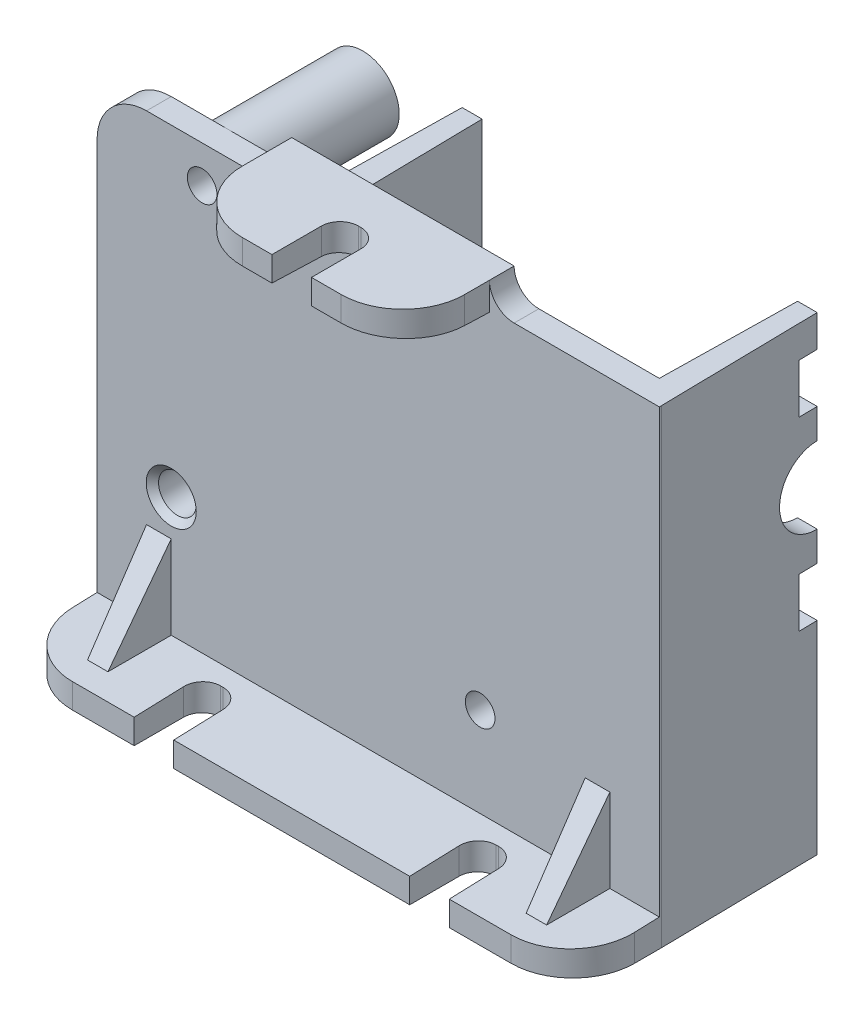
ISO-10303-21;
HEADER;
FILE_DESCRIPTION(('STEP AP214'),'2;1');
FILE_NAME('part.step','',(''),(''),'','','');
FILE_SCHEMA(('AUTOMOTIVE_DESIGN { 1 0 10303 214 1 1 1 1 }'));
ENDSEC;
DATA;
#1=APPLICATION_CONTEXT('core data for automotive mechanical design processes');
#2=APPLICATION_PROTOCOL_DEFINITION('international standard','automotive_design',2000,#1);
#3=PRODUCT_CONTEXT('',#1,'mechanical');
#4=PRODUCT('Part','Part','',(#3));
#5=PRODUCT_RELATED_PRODUCT_CATEGORY('part','',(#4));
#6=PRODUCT_DEFINITION_FORMATION('','',#4);
#7=PRODUCT_DEFINITION_CONTEXT('part definition',#1,'design');
#8=PRODUCT_DEFINITION('design','',#6,#7);
#9=PRODUCT_DEFINITION_SHAPE('','',#8);
#10=(LENGTH_UNIT() NAMED_UNIT(*) SI_UNIT(.MILLI.,.METRE.));
#11=(NAMED_UNIT(*) PLANE_ANGLE_UNIT() SI_UNIT($,.RADIAN.));
#12=(NAMED_UNIT(*) SI_UNIT($,.STERADIAN.) SOLID_ANGLE_UNIT());
#13=UNCERTAINTY_MEASURE_WITH_UNIT(LENGTH_MEASURE(1.E-05),#10,'distance_accuracy_value','');
#14=(GEOMETRIC_REPRESENTATION_CONTEXT(3) GLOBAL_UNCERTAINTY_ASSIGNED_CONTEXT((#13)) GLOBAL_UNIT_ASSIGNED_CONTEXT((#10,
#11,#12)) REPRESENTATION_CONTEXT('',''));
#15=CARTESIAN_POINT('',(0.,0.,0.));
#16=DIRECTION('',(0.,0.,1.));
#17=DIRECTION('',(1.,0.,0.));
#18=AXIS2_PLACEMENT_3D('',#15,#16,#17);
#19=CARTESIAN_POINT('',(-70.8545559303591,78.3853960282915,1.77826503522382E-13));
#20=DIRECTION('',(0.,-1.,0.));
#21=DIRECTION('',(0.,0.,-1.));
#22=AXIS2_PLACEMENT_3D('',#19,#20,#21);
#23=PLANE('',#22);
#24=DIRECTION('',(0.0174524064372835,0.,0.999847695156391));
#25=VECTOR('',#24,1.);
#26=CARTESIAN_POINT('',(-25.1382070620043,78.3853960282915,-0.797981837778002));
#27=LINE('',#26,#25);
#28=CARTESIAN_POINT('',(-25.3523286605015,78.3853960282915,-13.0649999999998));
#29=VERTEX_POINT('',#28);
#30=CARTESIAN_POINT('',(-25.1270559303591,78.3853960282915,-0.159133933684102));
#31=VERTEX_POINT('',#30);
#32=EDGE_CURVE('E500',#29,#31,#27,.T.);
#33=ORIENTED_EDGE('',*,*,#32,.F.);
#34=DIRECTION('',(-1.,0.,0.));
#35=VECTOR('',#34,1.);
#36=CARTESIAN_POINT('',(-70.8545559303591,78.3853960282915,-13.0649999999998));
#37=LINE('',#36,#35);
#38=CARTESIAN_POINT('',(-26.9440901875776,78.3853960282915,-13.0649999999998));
#39=VERTEX_POINT('',#38);
#40=EDGE_CURVE('E435',#29,#39,#37,.T.);
#41=ORIENTED_EDGE('',*,*,#40,.T.);
#42=DIRECTION('',(-0.0174524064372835,0.,0.999847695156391));
#43=VECTOR('',#42,1.);
#44=CARTESIAN_POINT('',(-27.1370559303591,78.3853960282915,-2.00999999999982));
#45=LINE('',#44,#43);
#46=CARTESIAN_POINT('',(-27.1370559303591,78.3853960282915,-2.00999999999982));
#47=VERTEX_POINT('',#46);
#48=EDGE_CURVE('E723',#47,#39,#45,.F.);
#49=ORIENTED_EDGE('',*,*,#48,.F.);
#50=DIRECTION('',(1.,0.,0.));
#51=VECTOR('',#50,1.);
#52=CARTESIAN_POINT('',(-27.1370559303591,78.3853960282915,-2.00999999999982));
#53=LINE('',#52,#51);
#54=CARTESIAN_POINT('',(-36.9358059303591,78.3853960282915,-2.00999999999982));
#55=VERTEX_POINT('',#54);
#56=EDGE_CURVE('E724',#55,#47,#53,.T.);
#57=ORIENTED_EDGE('',*,*,#56,.F.);
#58=DIRECTION('',(0.,0.,-1.));
#59=VECTOR('',#58,1.);
#60=CARTESIAN_POINT('',(-36.9358059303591,78.3853960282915,1.77826503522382E-13));
#61=LINE('',#60,#59);
#62=CARTESIAN_POINT('',(-36.9358059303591,78.3853960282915,1.77826503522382E-13));
#63=VERTEX_POINT('',#62);
#64=EDGE_CURVE('E823',#55,#63,#61,.F.);
#65=ORIENTED_EDGE('',*,*,#64,.T.);
#66=DIRECTION('',(-1.,0.,0.));
#67=VECTOR('',#66,1.);
#68=CARTESIAN_POINT('',(-70.8545559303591,78.3853960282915,1.77826503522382E-13));
#69=LINE('',#68,#67);
#70=CARTESIAN_POINT('',(-25.1270559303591,78.3853960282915,1.77826503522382E-13));
#71=VERTEX_POINT('',#70);
#72=EDGE_CURVE('E734',#71,#63,#69,.T.);
#73=ORIENTED_EDGE('',*,*,#72,.F.);
#74=DIRECTION('',(0.,0.,-1.));
#75=VECTOR('',#74,1.);
#76=CARTESIAN_POINT('',(-25.1270559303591,78.3853960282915,1.77826503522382E-13));
#77=LINE('',#76,#75);
#78=EDGE_CURVE('E748',#71,#31,#77,.T.);
#79=ORIENTED_EDGE('',*,*,#78,.T.);
#80=EDGE_LOOP('',(#33,#41,#49,#57,#65,#73,#79));
#81=FACE_BOUND('',#80,.T.);
#82=ADVANCED_FACE('F16',(#81),#23,.F.);
#83=CARTESIAN_POINT('',(-25.1270559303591,78.3853960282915,1.77826503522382E-13));
#84=DIRECTION('',(-1.,0.,0.));
#85=DIRECTION('',(0.,0.,1.));
#86=AXIS2_PLACEMENT_3D('',#83,#84,#85);
#87=PLANE('',#86);
#88=DIRECTION('',(0.,-1.,0.));
#89=VECTOR('',#88,1.);
#90=CARTESIAN_POINT('',(-25.1270559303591,78.3853960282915,-0.159133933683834));
#91=LINE('',#90,#89);
#92=CARTESIAN_POINT('',(-25.1270559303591,40.1953960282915,-0.159133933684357));
#93=VERTEX_POINT('',#92);
#94=EDGE_CURVE('E32',#31,#93,#91,.T.);
#95=ORIENTED_EDGE('',*,*,#94,.F.);
#96=ORIENTED_EDGE('',*,*,#78,.F.);
#97=DIRECTION('',(0.,1.,0.));
#98=VECTOR('',#97,1.);
#99=CARTESIAN_POINT('',(-25.1270559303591,78.3853960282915,1.77826503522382E-13));
#100=LINE('',#99,#98);
#101=CARTESIAN_POINT('',(-25.1270559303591,42.4510636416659,1.77826503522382E-13));
#102=VERTEX_POINT('',#101);
#103=EDGE_CURVE('E729',#102,#71,#100,.T.);
#104=ORIENTED_EDGE('',*,*,#103,.F.);
#105=DIRECTION('',(0.,0.034899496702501,-0.999390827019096));
#106=VECTOR('',#105,1.);
#107=CARTESIAN_POINT('',(-25.1270559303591,42.4948307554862,-1.25332615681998));
#108=LINE('',#107,#106);
#109=CARTESIAN_POINT('',(-25.1270559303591,42.3808728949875,2.01000000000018));
#110=VERTEX_POINT('',#109);
#111=EDGE_CURVE('E1000',#102,#110,#108,.F.);
#112=ORIENTED_EDGE('',*,*,#111,.T.);
#113=DIRECTION('',(0.,-1.,0.));
#114=VECTOR('',#113,1.);
#115=CARTESIAN_POINT('',(-25.1270559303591,40.1953960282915,2.01000000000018));
#116=LINE('',#115,#114);
#117=CARTESIAN_POINT('',(-25.1270559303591,40.1953960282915,2.01000000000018));
#118=VERTEX_POINT('',#117);
#119=EDGE_CURVE('E764',#110,#118,#116,.T.);
#120=ORIENTED_EDGE('',*,*,#119,.T.);
#121=DIRECTION('',(0.,0.,-1.));
#122=VECTOR('',#121,1.);
#123=CARTESIAN_POINT('',(-25.1270559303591,40.1953960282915,1.77826503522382E-13));
#124=LINE('',#123,#122);
#125=EDGE_CURVE('E741',#118,#93,#124,.T.);
#126=ORIENTED_EDGE('',*,*,#125,.T.);
#127=EDGE_LOOP('',(#95,#96,#104,#112,#120,#126));
#128=FACE_BOUND('',#127,.T.);
#129=ADVANCED_FACE('F3187',(#128),#87,.F.);
#130=CARTESIAN_POINT('',(-70.8545559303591,40.1953960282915,1.77826503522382E-13));
#131=DIRECTION('',(0.,1.,0.));
#132=DIRECTION('',(0.,0.,1.));
#133=AXIS2_PLACEMENT_3D('',#130,#131,#132);
#134=PLANE('',#133);
#135=DIRECTION('',(-0.0174524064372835,0.,-0.999847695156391));
#136=VECTOR('',#135,1.);
#137=CARTESIAN_POINT('',(-25.1382070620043,40.1953960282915,-0.797981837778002));
#138=LINE('',#137,#136);
#139=CARTESIAN_POINT('',(-25.3523286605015,40.1953960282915,-13.0649999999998));
#140=VERTEX_POINT('',#139);
#141=EDGE_CURVE('E40',#93,#140,#138,.T.);
#142=ORIENTED_EDGE('',*,*,#141,.F.);
#143=ORIENTED_EDGE('',*,*,#125,.F.);
#144=CARTESIAN_POINT('',(-30.1520559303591,40.1953960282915,2.01000000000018));
#145=DIRECTION('',(0.,1.,0.));
#146=DIRECTION('',(0.,0.,1.));
#147=AXIS2_PLACEMENT_3D('',#144,#145,#146);
#148=CIRCLE('',#147,5.025);
#149=CARTESIAN_POINT('',(-30.1520559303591,40.1953960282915,7.03500000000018));
#150=VERTEX_POINT('',#149);
#151=EDGE_CURVE('E757',#118,#150,#148,.F.);
#152=ORIENTED_EDGE('',*,*,#151,.T.);
#153=DIRECTION('',(-1.,0.,0.));
#154=VECTOR('',#153,1.);
#155=CARTESIAN_POINT('',(-70.8545559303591,40.1953960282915,7.03500000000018));
#156=LINE('',#155,#154);
#157=CARTESIAN_POINT('',(-35.1770559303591,40.1953960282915,7.03500000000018));
#158=VERTEX_POINT('',#157);
#159=EDGE_CURVE('E700',#150,#158,#156,.T.);
#160=ORIENTED_EDGE('',*,*,#159,.T.);
#161=DIRECTION('',(0.,0.,-1.));
#162=VECTOR('',#161,1.);
#163=CARTESIAN_POINT('',(-35.1770559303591,40.1953960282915,8.61871782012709));
#164=LINE('',#163,#162);
#165=CARTESIAN_POINT('',(-35.1770559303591,40.1953960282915,3.01500000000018));
#166=VERTEX_POINT('',#165);
#167=EDGE_CURVE('E664',#158,#166,#164,.T.);
#168=ORIENTED_EDGE('',*,*,#167,.T.);
#169=CARTESIAN_POINT('',(-36.6845559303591,40.1953960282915,3.01500000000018));
#170=DIRECTION('',(0.,1.,0.));
#171=DIRECTION('',(0.,0.,-1.));
#172=AXIS2_PLACEMENT_3D('',#169,#170,#171);
#173=CIRCLE('',#172,1.5075);
#174=CARTESIAN_POINT('',(-36.6845559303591,40.1953960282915,1.50750000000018));
#175=VERTEX_POINT('',#174);
#176=EDGE_CURVE('E647',#166,#175,#173,.T.);
#177=ORIENTED_EDGE('',*,*,#176,.T.);
#178=DIRECTION('',(-1.,0.,0.));
#179=VECTOR('',#178,1.);
#180=CARTESIAN_POINT('',(-36.6845559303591,40.1953960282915,1.50750000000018));
#181=LINE('',#180,#179);
#182=CARTESIAN_POINT('',(-36.8855559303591,40.1953960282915,1.50750000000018));
#183=VERTEX_POINT('',#182);
#184=EDGE_CURVE('E651',#175,#183,#181,.T.);
#185=ORIENTED_EDGE('',*,*,#184,.T.);
#186=CARTESIAN_POINT('',(-36.8855559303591,40.1953960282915,3.01500000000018));
#187=DIRECTION('',(0.,1.,0.));
#188=DIRECTION('',(0.,0.,-1.));
#189=AXIS2_PLACEMENT_3D('',#186,#187,#188);
#190=CIRCLE('',#189,1.5075);
#191=CARTESIAN_POINT('',(-38.3930559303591,40.1953960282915,3.01500000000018));
#192=VERTEX_POINT('',#191);
#193=EDGE_CURVE('E656',#183,#192,#190,.T.);
#194=ORIENTED_EDGE('',*,*,#193,.T.);
#195=DIRECTION('',(0.,0.,1.));
#196=VECTOR('',#195,1.);
#197=CARTESIAN_POINT('',(-38.3930559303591,40.1953960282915,8.61871782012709));
#198=LINE('',#197,#196);
#199=CARTESIAN_POINT('',(-38.3930559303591,40.1953960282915,7.03500000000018));
#200=VERTEX_POINT('',#199);
#201=EDGE_CURVE('E660',#192,#200,#198,.T.);
#202=ORIENTED_EDGE('',*,*,#201,.T.);
#203=CARTESIAN_POINT('',(-57.5885559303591,40.1953960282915,7.03500000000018));
#204=VERTEX_POINT('',#203);
#205=EDGE_CURVE('E704',#200,#204,#156,.T.);
#206=ORIENTED_EDGE('',*,*,#205,.T.);
#207=DIRECTION('',(0.,0.,-1.));
#208=VECTOR('',#207,1.);
#209=CARTESIAN_POINT('',(-57.5885559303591,40.1953960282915,8.61871782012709));
#210=LINE('',#209,#208);
#211=CARTESIAN_POINT('',(-57.5885559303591,40.1953960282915,3.01500000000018));
#212=VERTEX_POINT('',#211);
#213=EDGE_CURVE('E634',#204,#212,#210,.T.);
#214=ORIENTED_EDGE('',*,*,#213,.T.);
#215=CARTESIAN_POINT('',(-59.0960559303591,40.1953960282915,3.01500000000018));
#216=DIRECTION('',(0.,1.,0.));
#217=DIRECTION('',(0.,0.,1.));
#218=AXIS2_PLACEMENT_3D('',#215,#216,#217);
#219=CIRCLE('',#218,1.5075);
#220=CARTESIAN_POINT('',(-59.0960559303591,40.1953960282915,1.50750000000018));
#221=VERTEX_POINT('',#220);
#222=EDGE_CURVE('E617',#212,#221,#219,.T.);
#223=ORIENTED_EDGE('',*,*,#222,.T.);
#224=DIRECTION('',(-1.,0.,0.));
#225=VECTOR('',#224,1.);
#226=CARTESIAN_POINT('',(-59.2970559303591,40.1953960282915,1.50750000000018));
#227=LINE('',#226,#225);
#228=CARTESIAN_POINT('',(-59.2970559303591,40.1953960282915,1.50750000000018));
#229=VERTEX_POINT('',#228);
#230=EDGE_CURVE('E621',#221,#229,#227,.T.);
#231=ORIENTED_EDGE('',*,*,#230,.T.);
#232=CARTESIAN_POINT('',(-59.2970559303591,40.1953960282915,3.01500000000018));
#233=DIRECTION('',(0.,1.,0.));
#234=DIRECTION('',(0.,0.,1.));
#235=AXIS2_PLACEMENT_3D('',#232,#233,#234);
#236=CIRCLE('',#235,1.5075);
#237=CARTESIAN_POINT('',(-60.8045559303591,40.1953960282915,3.01500000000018));
#238=VERTEX_POINT('',#237);
#239=EDGE_CURVE('E626',#229,#238,#236,.T.);
#240=ORIENTED_EDGE('',*,*,#239,.T.);
#241=DIRECTION('',(0.,0.,1.));
#242=VECTOR('',#241,1.);
#243=CARTESIAN_POINT('',(-60.8045559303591,40.1953960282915,8.61871782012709));
#244=LINE('',#243,#242);
#245=CARTESIAN_POINT('',(-60.8045559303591,40.1953960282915,7.03500000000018));
#246=VERTEX_POINT('',#245);
#247=EDGE_CURVE('E630',#238,#246,#244,.T.);
#248=ORIENTED_EDGE('',*,*,#247,.T.);
#249=CARTESIAN_POINT('',(-65.8295559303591,40.1953960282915,7.03500000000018));
#250=VERTEX_POINT('',#249);
#251=EDGE_CURVE('E699',#246,#250,#156,.T.);
#252=ORIENTED_EDGE('',*,*,#251,.T.);
#253=CARTESIAN_POINT('',(-65.8295559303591,40.1953960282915,2.01000000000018));
#254=DIRECTION('',(0.,1.,0.));
#255=DIRECTION('',(0.,0.,1.));
#256=AXIS2_PLACEMENT_3D('',#253,#254,#255);
#257=CIRCLE('',#256,5.025);
#258=CARTESIAN_POINT('',(-70.8545559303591,40.1953960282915,2.01000000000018));
#259=VERTEX_POINT('',#258);
#260=EDGE_CURVE('E760',#250,#259,#257,.F.);
#261=ORIENTED_EDGE('',*,*,#260,.T.);
#262=DIRECTION('',(0.,0.,-1.));
#263=VECTOR('',#262,1.);
#264=CARTESIAN_POINT('',(-70.8545559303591,40.1953960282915,1.77826503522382E-13));
#265=LINE('',#264,#263);
#266=CARTESIAN_POINT('',(-70.8545559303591,40.1953960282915,-2.00999999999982));
#267=VERTEX_POINT('',#266);
#268=EDGE_CURVE('E744',#259,#267,#265,.T.);
#269=ORIENTED_EDGE('',*,*,#268,.T.);
#270=DIRECTION('',(1.,0.,0.));
#271=VECTOR('',#270,1.);
#272=CARTESIAN_POINT('',(-70.8545559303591,40.1953960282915,-2.00999999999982));
#273=LINE('',#272,#271);
#274=CARTESIAN_POINT('',(-54.4228059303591,40.1953960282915,-2.00999999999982));
#275=VERTEX_POINT('',#274);
#276=EDGE_CURVE('E716',#267,#275,#273,.T.);
#277=ORIENTED_EDGE('',*,*,#276,.T.);
#278=DIRECTION('',(-0.0174524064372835,0.,0.999847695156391));
#279=VECTOR('',#278,1.);
#280=CARTESIAN_POINT('',(-54.4628848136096,40.1953960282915,0.286117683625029));
#281=LINE('',#280,#279);
#282=CARTESIAN_POINT('',(-54.2298401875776,40.1953960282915,-13.0649999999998));
#283=VERTEX_POINT('',#282);
#284=EDGE_CURVE('E695',#275,#283,#281,.F.);
#285=ORIENTED_EDGE('',*,*,#284,.T.);
#286=DIRECTION('',(1.,0.,0.));
#287=VECTOR('',#286,1.);
#288=CARTESIAN_POINT('',(-70.8545559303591,40.1953960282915,-13.0649999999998));
#289=LINE('',#288,#287);
#290=CARTESIAN_POINT('',(-52.6057716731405,40.1953960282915,-13.0649999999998));
#291=VERTEX_POINT('',#290);
#292=EDGE_CURVE('E570',#283,#291,#289,.T.);
#293=ORIENTED_EDGE('',*,*,#292,.T.);
#294=DIRECTION('',(-0.0174524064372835,0.,-0.999847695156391));
#295=VECTOR('',#294,1.);
#296=CARTESIAN_POINT('',(-52.3833490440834,40.1953960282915,-0.322416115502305));
#297=LINE('',#296,#295);
#298=CARTESIAN_POINT('',(-52.4128059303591,40.1953960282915,-2.00999999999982));
#299=VERTEX_POINT('',#298);
#300=EDGE_CURVE('E751',#291,#299,#297,.F.);
#301=ORIENTED_EDGE('',*,*,#300,.T.);
#302=DIRECTION('',(1.,0.,0.));
#303=VECTOR('',#302,1.);
#304=CARTESIAN_POINT('',(-70.8545559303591,40.1953960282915,-2.00999999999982));
#305=LINE('',#304,#303);
#306=CARTESIAN_POINT('',(-27.1370559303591,40.1953960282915,-2.00999999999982));
#307=VERTEX_POINT('',#306);
#308=EDGE_CURVE('E752',#299,#307,#305,.T.);
#309=ORIENTED_EDGE('',*,*,#308,.T.);
#310=DIRECTION('',(-0.0174524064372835,0.,0.999847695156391));
#311=VECTOR('',#310,1.);
#312=CARTESIAN_POINT('',(-27.1854456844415,40.1953960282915,0.762247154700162));
#313=LINE('',#312,#311);
#314=CARTESIAN_POINT('',(-26.9440901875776,40.1953960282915,-13.0649999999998));
#315=VERTEX_POINT('',#314);
#316=EDGE_CURVE('E756',#307,#315,#313,.F.);
#317=ORIENTED_EDGE('',*,*,#316,.T.);
#318=EDGE_CURVE('E566',#315,#140,#289,.T.);
#319=ORIENTED_EDGE('',*,*,#318,.T.);
#320=EDGE_LOOP('',(#142,#143,#152,#160,#168,#177,#185,#194,#202,#206,#214,#223,#231,#240,#248,
#252,#261,#269,#277,#285,#293,#301,#309,#317,#319));
#321=FACE_BOUND('',#320,.T.);
#322=ADVANCED_FACE('F1215',(#321),#134,.F.);
#323=CARTESIAN_POINT('',(-28.1420559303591,66.2449960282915,-13.0649999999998));
#324=DIRECTION('',(1.,0.,0.));
#325=DIRECTION('',(0.,1.,0.));
#326=AXIS2_PLACEMENT_3D('',#323,#324,#325);
#327=CYLINDRICAL_SURFACE('',#326,3.1155);
#328=CARTESIAN_POINT('',(-25.3523286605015,66.2449960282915,-13.0649999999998));
#329=DIRECTION('',(0.999847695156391,0.,-0.0174524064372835));
#330=DIRECTION('',(0.0174524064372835,0.,0.999847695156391));
#331=AXIS2_PLACEMENT_3D('',#328,#329,#330);
#332=ELLIPSE('',#331,3.11597457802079,3.1155);
#333=CARTESIAN_POINT('',(-25.3523286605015,63.1294960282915,-13.0649999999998));
#334=VERTEX_POINT('',#333);
#335=CARTESIAN_POINT('',(-25.3523286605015,69.3604960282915,-13.0649999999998));
#336=VERTEX_POINT('',#335);
#337=EDGE_CURVE('E446',#334,#336,#332,.F.);
#338=ORIENTED_EDGE('',*,*,#337,.F.);
#339=DIRECTION('',(1.,0.,0.));
#340=VECTOR('',#339,1.);
#341=CARTESIAN_POINT('',(-28.1420559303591,63.1294960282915,-13.0649999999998));
#342=LINE('',#341,#340);
#343=CARTESIAN_POINT('',(-26.9440901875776,63.1294960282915,-13.0649999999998));
#344=VERTEX_POINT('',#343);
#345=EDGE_CURVE('E580',#334,#344,#342,.F.);
#346=ORIENTED_EDGE('',*,*,#345,.T.);
#347=CARTESIAN_POINT('',(-26.9440901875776,66.2449960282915,-13.0649999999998));
#348=DIRECTION('',(-0.999847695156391,0.,-0.0174524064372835));
#349=DIRECTION('',(0.0174524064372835,0.,-0.999847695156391));
#350=AXIS2_PLACEMENT_3D('',#347,#348,#349);
#351=ELLIPSE('',#350,3.11597457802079,3.1155);
#352=CARTESIAN_POINT('',(-26.9440901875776,69.3604960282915,-13.0649999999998));
#353=VERTEX_POINT('',#352);
#354=EDGE_CURVE('E1056',#353,#344,#351,.F.);
#355=ORIENTED_EDGE('',*,*,#354,.F.);
#356=DIRECTION('',(1.,0.,0.));
#357=VECTOR('',#356,1.);
#358=CARTESIAN_POINT('',(-28.1420559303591,69.3604960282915,-13.0649999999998));
#359=LINE('',#358,#357);
#360=EDGE_CURVE('E589',#353,#336,#359,.T.);
#361=ORIENTED_EDGE('',*,*,#360,.T.);
#362=EDGE_LOOP('',(#338,#346,#355,#361));
#363=FACE_BOUND('',#362,.T.);
#364=ADVANCED_FACE('F3174',(#363),#327,.F.);
#365=CARTESIAN_POINT('',(-28.1420559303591,71.7724960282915,-14.5724999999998));
#366=DIRECTION('',(0.,-1.,0.));
#367=DIRECTION('',(0.,0.,-1.));
#368=AXIS2_PLACEMENT_3D('',#365,#366,#367);
#369=PLANE('',#368);
#370=DIRECTION('',(0.0174524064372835,0.,0.999847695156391));
#371=VECTOR('',#370,1.);
#372=CARTESIAN_POINT('',(-25.3794838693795,71.7724960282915,-14.6207208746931));
#373=LINE('',#372,#371);
#374=CARTESIAN_POINT('',(-25.3523286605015,71.7724960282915,-13.0649999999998));
#375=VERTEX_POINT('',#374);
#376=CARTESIAN_POINT('',(-25.3260151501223,71.7724960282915,-11.5574999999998));
#377=VERTEX_POINT('',#376);
#378=EDGE_CURVE('E439',#375,#377,#373,.T.);
#379=ORIENTED_EDGE('',*,*,#378,.F.);
#380=DIRECTION('',(-1.,0.,0.));
#381=VECTOR('',#380,1.);
#382=CARTESIAN_POINT('',(-28.1420559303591,71.7724960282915,-13.0649999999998));
#383=LINE('',#382,#381);
#384=CARTESIAN_POINT('',(-26.9440901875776,71.7724960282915,-13.0649999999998));
#385=VERTEX_POINT('',#384);
#386=EDGE_CURVE('E426',#375,#385,#383,.T.);
#387=ORIENTED_EDGE('',*,*,#386,.T.);
#388=DIRECTION('',(-0.0174524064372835,0.,0.999847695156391));
#389=VECTOR('',#388,1.);
#390=CARTESIAN_POINT('',(-27.1370559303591,71.7724960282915,-2.00999999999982));
#391=LINE('',#390,#389);
#392=CARTESIAN_POINT('',(-26.970403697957,71.7724960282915,-11.5574999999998));
#393=VERTEX_POINT('',#392);
#394=EDGE_CURVE('E1096',#393,#385,#391,.F.);
#395=ORIENTED_EDGE('',*,*,#394,.F.);
#396=DIRECTION('',(1.,0.,0.));
#397=VECTOR('',#396,1.);
#398=CARTESIAN_POINT('',(-28.1420559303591,71.7724960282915,-11.5574999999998));
#399=LINE('',#398,#397);
#400=EDGE_CURVE('E442',#393,#377,#399,.T.);
#401=ORIENTED_EDGE('',*,*,#400,.T.);
#402=EDGE_LOOP('',(#379,#387,#395,#401));
#403=FACE_BOUND('',#402,.T.);
#404=ADVANCED_FACE('F440',(#403),#369,.F.);
#405=CARTESIAN_POINT('',(-28.1420559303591,71.7724960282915,-11.5574999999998));
#406=DIRECTION('',(0.,0.,1.));
#407=DIRECTION('',(1.,0.,0.));
#408=AXIS2_PLACEMENT_3D('',#405,#406,#407);
#409=PLANE('',#408);
#410=DIRECTION('',(0.,1.,0.));
#411=VECTOR('',#410,1.);
#412=CARTESIAN_POINT('',(-25.3260151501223,71.7724960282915,-11.5574999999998));
#413=LINE('',#412,#411);
#414=CARTESIAN_POINT('',(-25.3260151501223,75.7924960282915,-11.5574999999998));
#415=VERTEX_POINT('',#414);
#416=EDGE_CURVE('E474',#377,#415,#413,.T.);
#417=ORIENTED_EDGE('',*,*,#416,.F.);
#418=ORIENTED_EDGE('',*,*,#400,.F.);
#419=DIRECTION('',(0.,1.,0.));
#420=VECTOR('',#419,1.);
#421=CARTESIAN_POINT('',(-26.970403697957,38.1853960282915,-11.5574999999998));
#422=LINE('',#421,#420);
#423=CARTESIAN_POINT('',(-26.970403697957,75.7924960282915,-11.5574999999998));
#424=VERTEX_POINT('',#423);
#425=EDGE_CURVE('E1110',#424,#393,#422,.F.);
#426=ORIENTED_EDGE('',*,*,#425,.F.);
#427=DIRECTION('',(1.,0.,0.));
#428=VECTOR('',#427,1.);
#429=CARTESIAN_POINT('',(-28.1420559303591,75.7924960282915,-11.5574999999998));
#430=LINE('',#429,#428);
#431=EDGE_CURVE('E606',#424,#415,#430,.T.);
#432=ORIENTED_EDGE('',*,*,#431,.T.);
#433=EDGE_LOOP('',(#417,#418,#426,#432));
#434=FACE_BOUND('',#433,.T.);
#435=ADVANCED_FACE('F3159',(#434),#409,.F.);
#436=CARTESIAN_POINT('',(-28.1420559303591,75.7924960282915,-14.5724999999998));
#437=DIRECTION('',(0.,1.,0.));
#438=DIRECTION('',(0.,0.,1.));
#439=AXIS2_PLACEMENT_3D('',#436,#437,#438);
#440=PLANE('',#439);
#441=DIRECTION('',(-0.0174524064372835,0.,-0.999847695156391));
#442=VECTOR('',#441,1.);
#443=CARTESIAN_POINT('',(-25.3794838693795,75.7924960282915,-14.6207208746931));
#444=LINE('',#443,#442);
#445=CARTESIAN_POINT('',(-25.3523286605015,75.7924960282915,-13.0649999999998));
#446=VERTEX_POINT('',#445);
#447=EDGE_CURVE('E485',#415,#446,#444,.T.);
#448=ORIENTED_EDGE('',*,*,#447,.F.);
#449=ORIENTED_EDGE('',*,*,#431,.F.);
#450=DIRECTION('',(0.0174524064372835,0.,-0.999847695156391));
#451=VECTOR('',#450,1.);
#452=CARTESIAN_POINT('',(-27.1370559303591,75.7924960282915,-2.00999999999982));
#453=LINE('',#452,#451);
#454=CARTESIAN_POINT('',(-26.9440901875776,75.7924960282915,-13.0649999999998));
#455=VERTEX_POINT('',#454);
#456=EDGE_CURVE('E1032',#455,#424,#453,.F.);
#457=ORIENTED_EDGE('',*,*,#456,.F.);
#458=DIRECTION('',(1.,0.,0.));
#459=VECTOR('',#458,1.);
#460=CARTESIAN_POINT('',(-28.1420559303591,75.7924960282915,-13.0649999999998));
#461=LINE('',#460,#459);
#462=EDGE_CURVE('E575',#455,#446,#461,.T.);
#463=ORIENTED_EDGE('',*,*,#462,.T.);
#464=EDGE_LOOP('',(#448,#449,#457,#463));
#465=FACE_BOUND('',#464,.T.);
#466=ADVANCED_FACE('F3151',(#465),#440,.F.);
#467=CARTESIAN_POINT('',(-28.1420559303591,60.7174960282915,-14.5724999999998));
#468=DIRECTION('',(0.,1.,0.));
#469=DIRECTION('',(0.,0.,1.));
#470=AXIS2_PLACEMENT_3D('',#467,#468,#469);
#471=PLANE('',#470);
#472=DIRECTION('',(-0.0174524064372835,0.,-0.999847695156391));
#473=VECTOR('',#472,1.);
#474=CARTESIAN_POINT('',(-25.3794838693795,60.7174960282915,-14.6207208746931));
#475=LINE('',#474,#473);
#476=CARTESIAN_POINT('',(-25.3260151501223,60.7174960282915,-11.5574999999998));
#477=VERTEX_POINT('',#476);
#478=CARTESIAN_POINT('',(-25.3523286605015,60.7174960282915,-13.0649999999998));
#479=VERTEX_POINT('',#478);
#480=EDGE_CURVE('E469',#477,#479,#475,.T.);
#481=ORIENTED_EDGE('',*,*,#480,.F.);
#482=DIRECTION('',(1.,0.,0.));
#483=VECTOR('',#482,1.);
#484=CARTESIAN_POINT('',(-28.1420559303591,60.7174960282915,-11.5574999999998));
#485=LINE('',#484,#483);
#486=CARTESIAN_POINT('',(-26.970403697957,60.7174960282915,-11.5574999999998));
#487=VERTEX_POINT('',#486);
#488=EDGE_CURVE('E607',#487,#477,#485,.T.);
#489=ORIENTED_EDGE('',*,*,#488,.F.);
#490=DIRECTION('',(0.0174524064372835,0.,-0.999847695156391));
#491=VECTOR('',#490,1.);
#492=CARTESIAN_POINT('',(-27.1370559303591,60.7174960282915,-2.00999999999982));
#493=LINE('',#492,#491);
#494=CARTESIAN_POINT('',(-26.9440901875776,60.7174960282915,-13.0649999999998));
#495=VERTEX_POINT('',#494);
#496=EDGE_CURVE('E761',#495,#487,#493,.F.);
#497=ORIENTED_EDGE('',*,*,#496,.F.);
#498=DIRECTION('',(1.,0.,0.));
#499=VECTOR('',#498,1.);
#500=CARTESIAN_POINT('',(-28.1420559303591,60.7174960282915,-13.0649999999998));
#501=LINE('',#500,#499);
#502=EDGE_CURVE('E568',#495,#479,#501,.T.);
#503=ORIENTED_EDGE('',*,*,#502,.T.);
#504=EDGE_LOOP('',(#481,#489,#497,#503));
#505=FACE_BOUND('',#504,.T.);
#506=ADVANCED_FACE('F3143',(#505),#471,.F.);
#507=CARTESIAN_POINT('',(-28.1420559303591,56.6974960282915,-14.5724999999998));
#508=DIRECTION('',(0.,-1.,0.));
#509=DIRECTION('',(0.,0.,-1.));
#510=AXIS2_PLACEMENT_3D('',#507,#508,#509);
#511=PLANE('',#510);
#512=DIRECTION('',(0.0174524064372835,0.,0.999847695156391));
#513=VECTOR('',#512,1.);
#514=CARTESIAN_POINT('',(-25.3794838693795,56.6974960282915,-14.6207208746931));
#515=LINE('',#514,#513);
#516=CARTESIAN_POINT('',(-25.3523286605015,56.6974960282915,-13.0649999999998));
#517=VERTEX_POINT('',#516);
#518=CARTESIAN_POINT('',(-25.3260151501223,56.6974960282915,-11.5574999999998));
#519=VERTEX_POINT('',#518);
#520=EDGE_CURVE('E481',#517,#519,#515,.T.);
#521=ORIENTED_EDGE('',*,*,#520,.F.);
#522=DIRECTION('',(-1.,0.,0.));
#523=VECTOR('',#522,1.);
#524=CARTESIAN_POINT('',(-28.1420559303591,56.6974960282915,-13.0649999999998));
#525=LINE('',#524,#523);
#526=CARTESIAN_POINT('',(-26.9440901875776,56.6974960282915,-13.0649999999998));
#527=VERTEX_POINT('',#526);
#528=EDGE_CURVE('E796',#517,#527,#525,.T.);
#529=ORIENTED_EDGE('',*,*,#528,.T.);
#530=DIRECTION('',(-0.0174524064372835,0.,0.999847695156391));
#531=VECTOR('',#530,1.);
#532=CARTESIAN_POINT('',(-27.1370559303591,56.6974960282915,-2.00999999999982));
#533=LINE('',#532,#531);
#534=CARTESIAN_POINT('',(-26.970403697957,56.6974960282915,-11.5574999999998));
#535=VERTEX_POINT('',#534);
#536=EDGE_CURVE('E1088',#535,#527,#533,.F.);
#537=ORIENTED_EDGE('',*,*,#536,.F.);
#538=DIRECTION('',(1.,0.,0.));
#539=VECTOR('',#538,1.);
#540=CARTESIAN_POINT('',(-28.1420559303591,56.6974960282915,-11.5574999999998));
#541=LINE('',#540,#539);
#542=EDGE_CURVE('E602',#535,#519,#541,.T.);
#543=ORIENTED_EDGE('',*,*,#542,.T.);
#544=EDGE_LOOP('',(#521,#529,#537,#543));
#545=FACE_BOUND('',#544,.T.);
#546=ADVANCED_FACE('F3135',(#545),#511,.F.);
#547=CARTESIAN_POINT('',(-28.1420559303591,60.7174960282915,-11.5574999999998));
#548=DIRECTION('',(0.,0.,1.));
#549=DIRECTION('',(1.,0.,0.));
#550=AXIS2_PLACEMENT_3D('',#547,#548,#549);
#551=PLANE('',#550);
#552=DIRECTION('',(0.,1.,0.));
#553=VECTOR('',#552,1.);
#554=CARTESIAN_POINT('',(-25.3260151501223,60.7174960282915,-11.5574999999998));
#555=LINE('',#554,#553);
#556=EDGE_CURVE('E477',#519,#477,#555,.T.);
#557=ORIENTED_EDGE('',*,*,#556,.F.);
#558=ORIENTED_EDGE('',*,*,#542,.F.);
#559=DIRECTION('',(0.,1.,0.));
#560=VECTOR('',#559,1.);
#561=CARTESIAN_POINT('',(-26.970403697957,38.1853960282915,-11.5574999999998));
#562=LINE('',#561,#560);
#563=EDGE_CURVE('E1092',#487,#535,#562,.F.);
#564=ORIENTED_EDGE('',*,*,#563,.F.);
#565=ORIENTED_EDGE('',*,*,#488,.T.);
#566=EDGE_LOOP('',(#557,#558,#564,#565));
#567=FACE_BOUND('',#566,.T.);
#568=ADVANCED_FACE('F3128',(#567),#551,.F.);
#569=CARTESIAN_POINT('',(-73.8592877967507,39.6094905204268,-13.0649999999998));
#570=DIRECTION('',(0.,0.,1.));
#571=DIRECTION('',(1.,0.,0.));
#572=AXIS2_PLACEMENT_3D('',#569,#570,#571);
#573=PLANE('',#572);
#574=DIRECTION('',(0.,1.,0.));
#575=VECTOR('',#574,1.);
#576=CARTESIAN_POINT('',(-25.3523286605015,39.6094905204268,-13.0649999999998));
#577=LINE('',#576,#575);
#578=EDGE_CURVE('E492',#140,#517,#577,.T.);
#579=ORIENTED_EDGE('',*,*,#578,.F.);
#580=ORIENTED_EDGE('',*,*,#318,.F.);
#581=DIRECTION('',(0.,1.,0.));
#582=VECTOR('',#581,1.);
#583=CARTESIAN_POINT('',(-26.9440901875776,38.1853960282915,-13.0649999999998));
#584=LINE('',#583,#582);
#585=EDGE_CURVE('E569',#527,#315,#584,.F.);
#586=ORIENTED_EDGE('',*,*,#585,.F.);
#587=ORIENTED_EDGE('',*,*,#528,.F.);
#588=EDGE_LOOP('',(#579,#580,#586,#587));
#589=FACE_BOUND('',#588,.T.);
#590=ADVANCED_FACE('F2813',(#589),#573,.F.);
#591=DIRECTION('',(0.,1.,0.));
#592=VECTOR('',#591,1.);
#593=CARTESIAN_POINT('',(-25.3523286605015,39.6094905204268,-13.0649999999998));
#594=LINE('',#593,#592);
#595=EDGE_CURVE('E453',#479,#334,#594,.T.);
#596=ORIENTED_EDGE('',*,*,#595,.F.);
#597=ORIENTED_EDGE('',*,*,#502,.F.);
#598=DIRECTION('',(0.,1.,0.));
#599=VECTOR('',#598,1.);
#600=CARTESIAN_POINT('',(-26.9440901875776,38.1853960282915,-13.0649999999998));
#601=LINE('',#600,#599);
#602=EDGE_CURVE('E574',#344,#495,#601,.F.);
#603=ORIENTED_EDGE('',*,*,#602,.F.);
#604=ORIENTED_EDGE('',*,*,#345,.F.);
#605=EDGE_LOOP('',(#596,#597,#603,#604));
#606=FACE_BOUND('',#605,.T.);
#607=ADVANCED_FACE('F3115',(#606),#573,.F.);
#608=DIRECTION('',(0.,1.,0.));
#609=VECTOR('',#608,1.);
#610=CARTESIAN_POINT('',(-25.3523286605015,39.6094905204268,-13.0649999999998));
#611=LINE('',#610,#609);
#612=EDGE_CURVE('E489',#446,#29,#611,.T.);
#613=ORIENTED_EDGE('',*,*,#612,.F.);
#614=ORIENTED_EDGE('',*,*,#462,.F.);
#615=DIRECTION('',(0.,1.,0.));
#616=VECTOR('',#615,1.);
#617=CARTESIAN_POINT('',(-26.9440901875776,38.1853960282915,-13.0649999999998));
#618=LINE('',#617,#616);
#619=EDGE_CURVE('E579',#39,#455,#618,.F.);
#620=ORIENTED_EDGE('',*,*,#619,.F.);
#621=ORIENTED_EDGE('',*,*,#40,.F.);
#622=EDGE_LOOP('',(#613,#614,#620,#621));
#623=FACE_BOUND('',#622,.T.);
#624=ADVANCED_FACE('F3109',(#623),#573,.F.);
#625=DIRECTION('',(0.,1.,0.));
#626=VECTOR('',#625,1.);
#627=CARTESIAN_POINT('',(-25.3523286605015,39.6094905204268,-13.0649999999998));
#628=LINE('',#627,#626);
#629=EDGE_CURVE('E11',#336,#375,#628,.T.);
#630=ORIENTED_EDGE('',*,*,#629,.F.);
#631=ORIENTED_EDGE('',*,*,#360,.F.);
#632=DIRECTION('',(0.,1.,0.));
#633=VECTOR('',#632,1.);
#634=CARTESIAN_POINT('',(-26.9440901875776,38.1853960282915,-13.0649999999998));
#635=LINE('',#634,#633);
#636=EDGE_CURVE('E431',#385,#353,#635,.F.);
#637=ORIENTED_EDGE('',*,*,#636,.F.);
#638=ORIENTED_EDGE('',*,*,#386,.F.);
#639=EDGE_LOOP('',(#630,#631,#637,#638));
#640=FACE_BOUND('',#639,.T.);
#641=ADVANCED_FACE('F428',(#640),#573,.F.);
#642=DIRECTION('',(-1.,0.,0.));
#643=VECTOR('',#642,1.);
#644=CARTESIAN_POINT('',(-57.0358059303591,78.3853960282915,-2.00999999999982));
#645=LINE('',#644,#643);
#646=CARTESIAN_POINT('',(-52.4128059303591,78.3853960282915,-2.00999999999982));
#647=VERTEX_POINT('',#646);
#648=CARTESIAN_POINT('',(-54.4228059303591,78.3853960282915,-2.00999999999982));
#649=VERTEX_POINT('',#648);
#650=EDGE_CURVE('E505',#647,#649,#645,.T.);
#651=ORIENTED_EDGE('',*,*,#650,.F.);
#652=DIRECTION('',(-0.0174524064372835,0.,-0.999847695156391));
#653=VECTOR('',#652,1.);
#654=CARTESIAN_POINT('',(-52.4128059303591,78.3853960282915,-2.00999999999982));
#655=LINE('',#654,#653);
#656=CARTESIAN_POINT('',(-52.6057716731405,78.3853960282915,-13.0649999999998));
#657=VERTEX_POINT('',#656);
#658=EDGE_CURVE('E728',#657,#647,#655,.F.);
#659=ORIENTED_EDGE('',*,*,#658,.F.);
#660=CARTESIAN_POINT('',(-54.2298401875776,78.3853960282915,-13.0649999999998));
#661=VERTEX_POINT('',#660);
#662=EDGE_CURVE('E582',#657,#661,#37,.T.);
#663=ORIENTED_EDGE('',*,*,#662,.T.);
#664=DIRECTION('',(-0.0174524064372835,0.,0.999847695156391));
#665=VECTOR('',#664,1.);
#666=CARTESIAN_POINT('',(-54.4228059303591,78.3853960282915,-2.00999999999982));
#667=LINE('',#666,#665);
#668=EDGE_CURVE('E709',#649,#661,#667,.F.);
#669=ORIENTED_EDGE('',*,*,#668,.F.);
#670=EDGE_LOOP('',(#651,#659,#663,#669));
#671=FACE_BOUND('',#670,.T.);
#672=ADVANCED_FACE('F1203',(#671),#23,.F.);
#673=CARTESIAN_POINT('',(-59.0458059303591,78.3853960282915,1.77826503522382E-13));
#674=VERTEX_POINT('',#673);
#675=CARTESIAN_POINT('',(-66.8345559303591,78.3853960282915,1.77826503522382E-13));
#676=VERTEX_POINT('',#675);
#677=EDGE_CURVE('E732',#674,#676,#69,.T.);
#678=ORIENTED_EDGE('',*,*,#677,.F.);
#679=DIRECTION('',(0.,0.,1.));
#680=VECTOR('',#679,1.);
#681=CARTESIAN_POINT('',(-59.0458059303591,78.3853960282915,-2.00999999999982));
#682=LINE('',#681,#680);
#683=CARTESIAN_POINT('',(-59.0458059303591,78.3853960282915,-2.00999999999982));
#684=VERTEX_POINT('',#683);
#685=EDGE_CURVE('E830',#674,#684,#682,.F.);
#686=ORIENTED_EDGE('',*,*,#685,.T.);
#687=DIRECTION('',(1.,0.,0.));
#688=VECTOR('',#687,1.);
#689=CARTESIAN_POINT('',(-54.4228059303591,78.3853960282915,-2.00999999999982));
#690=LINE('',#689,#688);
#691=CARTESIAN_POINT('',(-66.8345559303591,78.3853960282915,-2.00999999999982));
#692=VERTEX_POINT('',#691);
#693=EDGE_CURVE('E711',#692,#684,#690,.T.);
#694=ORIENTED_EDGE('',*,*,#693,.F.);
#695=DIRECTION('',(0.,0.,-1.));
#696=VECTOR('',#695,1.);
#697=CARTESIAN_POINT('',(-66.8345559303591,78.3853960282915,1.77826503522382E-13));
#698=LINE('',#697,#696);
#699=EDGE_CURVE('E765',#692,#676,#698,.F.);
#700=ORIENTED_EDGE('',*,*,#699,.T.);
#701=EDGE_LOOP('',(#678,#686,#694,#700));
#702=FACE_BOUND('',#701,.T.);
#703=ADVANCED_FACE('F3089',(#702),#23,.F.);
#704=CARTESIAN_POINT('',(-25.1270559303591,40.1953960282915,1.77826503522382E-13));
#705=DIRECTION('',(0.,0.,1.));
#706=DIRECTION('',(1.,0.,0.));
#707=AXIS2_PLACEMENT_3D('',#704,#705,#706);
#708=PLANE('',#707);
#709=CARTESIAN_POINT('',(-64.8245559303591,52.1749960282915,1.77826503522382E-13));
#710=DIRECTION('',(0.,0.,1.));
#711=DIRECTION('',(1.,0.,0.));
#712=AXIS2_PLACEMENT_3D('',#709,#710,#711);
#713=CIRCLE('',#712,2.035125);
#714=CARTESIAN_POINT('',(-62.7894309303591,52.1749960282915,1.77826503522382E-13));
#715=VERTEX_POINT('',#714);
#716=EDGE_CURVE('E788',#715,#715,#713,.F.);
#717=ORIENTED_EDGE('',*,*,#716,.T.);
#718=EDGE_LOOP('',(#717));
#719=FACE_BOUND('',#718,.T.);
#720=CARTESIAN_POINT('',(-39.6995559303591,49.7428960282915,1.77826503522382E-13));
#721=DIRECTION('',(0.,0.,1.));
#722=DIRECTION('',(1.,0.,0.));
#723=AXIS2_PLACEMENT_3D('',#720,#721,#722);
#724=CIRCLE('',#723,1.206);
#725=CARTESIAN_POINT('',(-38.4935559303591,49.7428960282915,1.77826503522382E-13));
#726=VERTEX_POINT('',#725);
#727=EDGE_CURVE('E677',#726,#726,#724,.T.);
#728=ORIENTED_EDGE('',*,*,#727,.F.);
#729=EDGE_LOOP('',(#728));
#730=FACE_BOUND('',#729,.T.);
#731=CARTESIAN_POINT('',(-62.3120559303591,75.3703960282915,1.77826503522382E-13));
#732=DIRECTION('',(0.,0.,1.));
#733=DIRECTION('',(1.,0.,0.));
#734=AXIS2_PLACEMENT_3D('',#731,#732,#733);
#735=CIRCLE('',#734,1.206);
#736=CARTESIAN_POINT('',(-61.1060559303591,75.3703960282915,1.77826503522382E-13));
#737=VERTEX_POINT('',#736);
#738=EDGE_CURVE('E681',#737,#737,#735,.T.);
#739=ORIENTED_EDGE('',*,*,#738,.F.);
#740=EDGE_LOOP('',(#739));
#741=FACE_BOUND('',#740,.T.);
#742=DIRECTION('',(-1.,0.,0.));
#743=VECTOR('',#742,1.);
#744=CARTESIAN_POINT('',(-25.1270559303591,49.2403960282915,1.77826503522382E-13));
#745=LINE('',#744,#743);
#746=CARTESIAN_POINT('',(-64.8245559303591,49.2403960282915,1.77826503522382E-13));
#747=VERTEX_POINT('',#746);
#748=CARTESIAN_POINT('',(-66.8345559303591,49.2403960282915,1.77826503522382E-13));
#749=VERTEX_POINT('',#748);
#750=EDGE_CURVE('E814',#747,#749,#745,.T.);
#751=ORIENTED_EDGE('',*,*,#750,.F.);
#752=DIRECTION('',(0.,1.,0.));
#753=VECTOR('',#752,1.);
#754=CARTESIAN_POINT('',(-64.8245559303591,40.1953960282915,1.77826503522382E-13));
#755=LINE('',#754,#753);
#756=CARTESIAN_POINT('',(-64.8245559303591,42.4510636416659,1.77826503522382E-13));
#757=VERTEX_POINT('',#756);
#758=EDGE_CURVE('E920',#747,#757,#755,.F.);
#759=ORIENTED_EDGE('',*,*,#758,.T.);
#760=DIRECTION('',(-1.,0.,0.));
#761=VECTOR('',#760,1.);
#762=CARTESIAN_POINT('',(-25.1270559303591,42.4510636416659,1.77826503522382E-13));
#763=LINE('',#762,#761);
#764=CARTESIAN_POINT('',(-31.1570559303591,42.4510636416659,1.77826503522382E-13));
#765=VERTEX_POINT('',#764);
#766=EDGE_CURVE('E983',#757,#765,#763,.F.);
#767=ORIENTED_EDGE('',*,*,#766,.T.);
#768=DIRECTION('',(0.,-1.,0.));
#769=VECTOR('',#768,1.);
#770=CARTESIAN_POINT('',(-31.1570559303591,40.1953960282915,1.77826503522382E-13));
#771=LINE('',#770,#769);
#772=CARTESIAN_POINT('',(-31.1570559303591,49.2403960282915,1.77826503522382E-13));
#773=VERTEX_POINT('',#772);
#774=EDGE_CURVE('E928',#765,#773,#771,.F.);
#775=ORIENTED_EDGE('',*,*,#774,.T.);
#776=DIRECTION('',(-1.,0.,0.));
#777=VECTOR('',#776,1.);
#778=CARTESIAN_POINT('',(-25.1270559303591,49.2403960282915,1.77826503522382E-13));
#779=LINE('',#778,#777);
#780=CARTESIAN_POINT('',(-29.1470559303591,49.2403960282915,1.77826503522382E-13));
#781=VERTEX_POINT('',#780);
#782=EDGE_CURVE('E808',#781,#773,#779,.T.);
#783=ORIENTED_EDGE('',*,*,#782,.F.);
#784=DIRECTION('',(0.,1.,0.));
#785=VECTOR('',#784,1.);
#786=CARTESIAN_POINT('',(-29.1470559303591,40.1953960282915,1.77826503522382E-13));
#787=LINE('',#786,#785);
#788=CARTESIAN_POINT('',(-29.1470559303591,42.4510636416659,1.77826503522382E-13));
#789=VERTEX_POINT('',#788);
#790=EDGE_CURVE('E561',#781,#789,#787,.F.);
#791=ORIENTED_EDGE('',*,*,#790,.T.);
#792=DIRECTION('',(-1.,0.,0.));
#793=VECTOR('',#792,1.);
#794=CARTESIAN_POINT('',(-25.1270559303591,42.4510636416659,1.77826503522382E-13));
#795=LINE('',#794,#793);
#796=EDGE_CURVE('E987',#789,#102,#795,.F.);
#797=ORIENTED_EDGE('',*,*,#796,.T.);
#798=ORIENTED_EDGE('',*,*,#103,.T.);
#799=ORIENTED_EDGE('',*,*,#72,.T.);
#800=CARTESIAN_POINT('',(-36.9358059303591,80.3953960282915,1.77826503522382E-13));
#801=DIRECTION('',(0.,0.,1.));
#802=DIRECTION('',(1.,0.,0.));
#803=AXIS2_PLACEMENT_3D('',#800,#801,#802);
#804=CIRCLE('',#803,2.01);
#805=CARTESIAN_POINT('',(-38.9458059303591,80.3953960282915,1.77826503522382E-13));
#806=VERTEX_POINT('',#805);
#807=EDGE_CURVE('E836',#63,#806,#804,.F.);
#808=ORIENTED_EDGE('',*,*,#807,.T.);
#809=DIRECTION('',(0.,1.,0.));
#810=VECTOR('',#809,1.);
#811=CARTESIAN_POINT('',(-38.9458059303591,80.3953960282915,1.77826503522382E-13));
#812=LINE('',#811,#810);
#813=CARTESIAN_POINT('',(-38.9458059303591,78.139728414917,1.77826503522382E-13));
#814=VERTEX_POINT('',#813);
#815=EDGE_CURVE('E819',#814,#806,#812,.T.);
#816=ORIENTED_EDGE('',*,*,#815,.F.);
#817=DIRECTION('',(1.,0.,0.));
#818=VECTOR('',#817,1.);
#819=CARTESIAN_POINT('',(-25.1270559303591,78.139728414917,1.77826503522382E-13));
#820=LINE('',#819,#818);
#821=CARTESIAN_POINT('',(-57.0358059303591,78.139728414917,1.77826503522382E-13));
#822=VERTEX_POINT('',#821);
#823=EDGE_CURVE('E554',#822,#814,#820,.T.);
#824=ORIENTED_EDGE('',*,*,#823,.F.);
#825=DIRECTION('',(0.,-1.,0.));
#826=VECTOR('',#825,1.);
#827=CARTESIAN_POINT('',(-57.0358059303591,80.3953960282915,1.77826503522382E-13));
#828=LINE('',#827,#826);
#829=CARTESIAN_POINT('',(-57.0358059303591,80.3953960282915,1.77826503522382E-13));
#830=VERTEX_POINT('',#829);
#831=EDGE_CURVE('E827',#830,#822,#828,.T.);
#832=ORIENTED_EDGE('',*,*,#831,.F.);
#833=CARTESIAN_POINT('',(-59.0458059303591,80.3953960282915,1.77826503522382E-13));
#834=DIRECTION('',(0.,0.,1.));
#835=DIRECTION('',(1.,0.,0.));
#836=AXIS2_PLACEMENT_3D('',#833,#834,#835);
#837=CIRCLE('',#836,2.01);
#838=EDGE_CURVE('E840',#830,#674,#837,.F.);
#839=ORIENTED_EDGE('',*,*,#838,.T.);
#840=ORIENTED_EDGE('',*,*,#677,.T.);
#841=CARTESIAN_POINT('',(-66.8345559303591,74.3653960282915,1.77826503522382E-13));
#842=DIRECTION('',(0.,0.,1.));
#843=DIRECTION('',(1.,0.,0.));
#844=AXIS2_PLACEMENT_3D('',#841,#842,#843);
#845=CIRCLE('',#844,4.02);
#846=CARTESIAN_POINT('',(-70.8545559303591,74.3653960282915,1.77826503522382E-13));
#847=VERTEX_POINT('',#846);
#848=EDGE_CURVE('E777',#676,#847,#845,.T.);
#849=ORIENTED_EDGE('',*,*,#848,.T.);
#850=DIRECTION('',(0.,-1.,0.));
#851=VECTOR('',#850,1.);
#852=CARTESIAN_POINT('',(-70.8545559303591,78.3853960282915,1.77826503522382E-13));
#853=LINE('',#852,#851);
#854=CARTESIAN_POINT('',(-70.8545559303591,42.4510636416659,1.77826503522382E-13));
#855=VERTEX_POINT('',#854);
#856=EDGE_CURVE('E738',#847,#855,#853,.T.);
#857=ORIENTED_EDGE('',*,*,#856,.T.);
#858=DIRECTION('',(-1.,0.,0.));
#859=VECTOR('',#858,1.);
#860=CARTESIAN_POINT('',(-25.1270559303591,42.4510636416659,1.77826503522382E-13));
#861=LINE('',#860,#859);
#862=CARTESIAN_POINT('',(-66.8345559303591,42.4510636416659,1.77826503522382E-13));
#863=VERTEX_POINT('',#862);
#864=EDGE_CURVE('E986',#855,#863,#861,.F.);
#865=ORIENTED_EDGE('',*,*,#864,.T.);
#866=DIRECTION('',(0.,-1.,0.));
#867=VECTOR('',#866,1.);
#868=CARTESIAN_POINT('',(-66.8345559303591,40.1953960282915,1.77826503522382E-13));
#869=LINE('',#868,#867);
#870=EDGE_CURVE('E916',#863,#749,#869,.F.);
#871=ORIENTED_EDGE('',*,*,#870,.T.);
#872=EDGE_LOOP('',(#751,#759,#767,#775,#783,#791,#797,#798,#799,#808,#816,#824,#832,#839,#840,
#849,#857,#865,#871));
#873=FACE_BOUND('',#872,.T.);
#874=ADVANCED_FACE('F3081',(#719,#730,#741,#873),#708,.T.);
#875=CARTESIAN_POINT('',(-70.8545559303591,42.2053960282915,7.03500000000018));
#876=DIRECTION('',(0.,0.999390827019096,0.0348994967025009));
#877=DIRECTION('',(0.,0.034899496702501,-0.999390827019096));
#878=AXIS2_PLACEMENT_3D('',#875,#876,#877);
#879=PLANE('',#878);
#880=DIRECTION('',(0.0348782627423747,0.0348782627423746,-0.998782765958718));
#881=VECTOR('',#880,1.);
#882=CARTESIAN_POINT('',(-65.0772601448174,42.1983594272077,7.23650189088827));
#883=LINE('',#882,#881);
#884=CARTESIAN_POINT('',(-64.998237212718,42.2773823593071,4.97358119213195));
#885=VERTEX_POINT('',#884);
#886=EDGE_CURVE('E886',#885,#757,#883,.T.);
#887=ORIENTED_EDGE('',*,*,#886,.F.);
#888=DIRECTION('',(-1.,0.,0.));
#889=VECTOR('',#888,1.);
#890=CARTESIAN_POINT('',(-64.8245559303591,42.2773823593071,4.97358119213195));
#891=LINE('',#890,#889);
#892=CARTESIAN_POINT('',(-66.6608746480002,42.2773823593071,4.97358119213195));
#893=VERTEX_POINT('',#892);
#894=EDGE_CURVE('E921',#893,#885,#891,.F.);
#895=ORIENTED_EDGE('',*,*,#894,.F.);
#896=DIRECTION('',(0.0348782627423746,-0.0348782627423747,0.998782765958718));
#897=VECTOR('',#896,1.);
#898=CARTESIAN_POINT('',(-66.5940774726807,42.2105851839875,6.88640202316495));
#899=LINE('',#898,#897);
#900=EDGE_CURVE('E812',#863,#893,#899,.T.);
#901=ORIENTED_EDGE('',*,*,#900,.F.);
#902=ORIENTED_EDGE('',*,*,#864,.F.);
#903=DIRECTION('',(0.,-0.034899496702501,0.999390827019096));
#904=VECTOR('',#903,1.);
#905=CARTESIAN_POINT('',(-70.8545559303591,42.4948307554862,-1.25332615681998));
#906=LINE('',#905,#904);
#907=CARTESIAN_POINT('',(-70.8545559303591,42.3808728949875,2.01000000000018));
#908=VERTEX_POINT('',#907);
#909=EDGE_CURVE('E703',#908,#855,#906,.F.);
#910=ORIENTED_EDGE('',*,*,#909,.F.);
#911=CARTESIAN_POINT('',(-65.8295559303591,42.3808728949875,2.01000000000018));
#912=DIRECTION('',(0.,0.999390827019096,0.0348994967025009));
#913=DIRECTION('',(0.,0.034899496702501,-0.999390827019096));
#914=AXIS2_PLACEMENT_3D('',#911,#912,#913);
#915=ELLIPSE('',#914,5.02806296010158,5.025);
#916=CARTESIAN_POINT('',(-65.8295559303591,42.2053960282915,7.03500000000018));
#917=VERTEX_POINT('',#916);
#918=EDGE_CURVE('E948',#908,#917,#915,.T.);
#919=ORIENTED_EDGE('',*,*,#918,.T.);
#920=DIRECTION('',(1.,0.,0.));
#921=VECTOR('',#920,1.);
#922=CARTESIAN_POINT('',(-70.8545559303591,42.2053960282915,7.03500000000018));
#923=LINE('',#922,#921);
#924=CARTESIAN_POINT('',(-60.8045559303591,42.2053960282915,7.03500000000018));
#925=VERTEX_POINT('',#924);
#926=EDGE_CURVE('E1004',#925,#917,#923,.F.);
#927=ORIENTED_EDGE('',*,*,#926,.F.);
#928=DIRECTION('',(0.,0.034899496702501,-0.999390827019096));
#929=VECTOR('',#928,1.);
#930=CARTESIAN_POINT('',(-60.8045559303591,42.1477106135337,8.68689414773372));
#931=LINE('',#930,#929);
#932=CARTESIAN_POINT('',(-60.8045559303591,42.3457775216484,3.01500000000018));
#933=VERTEX_POINT('',#932);
#934=EDGE_CURVE('E622',#933,#925,#931,.F.);
#935=ORIENTED_EDGE('',*,*,#934,.F.);
#936=CARTESIAN_POINT('',(-59.2970559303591,42.3457775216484,3.01500000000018));
#937=DIRECTION('',(0.,0.999390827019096,0.0348994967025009));
#938=DIRECTION('',(0.,0.034899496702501,-0.999390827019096));
#939=AXIS2_PLACEMENT_3D('',#936,#937,#938);
#940=ELLIPSE('',#939,1.50841888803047,1.5075);
#941=CARTESIAN_POINT('',(-59.2970559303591,42.3984205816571,1.50750000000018));
#942=VERTEX_POINT('',#941);
#943=EDGE_CURVE('E1039',#942,#933,#940,.T.);
#944=ORIENTED_EDGE('',*,*,#943,.F.);
#945=DIRECTION('',(1.,0.,0.));
#946=VECTOR('',#945,1.);
#947=CARTESIAN_POINT('',(-59.2970559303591,42.3984205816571,1.50750000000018));
#948=LINE('',#947,#946);
#949=CARTESIAN_POINT('',(-59.0960559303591,42.3984205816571,1.50750000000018));
#950=VERTEX_POINT('',#949);
#951=EDGE_CURVE('E1035',#950,#942,#948,.F.);
#952=ORIENTED_EDGE('',*,*,#951,.F.);
#953=CARTESIAN_POINT('',(-59.0960559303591,42.3457775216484,3.01500000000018));
#954=DIRECTION('',(0.,0.999390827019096,0.0348994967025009));
#955=DIRECTION('',(0.,0.034899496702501,-0.999390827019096));
#956=AXIS2_PLACEMENT_3D('',#953,#954,#955);
#957=ELLIPSE('',#956,1.50841888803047,1.5075);
#958=CARTESIAN_POINT('',(-57.5885559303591,42.3457775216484,3.01500000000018));
#959=VERTEX_POINT('',#958);
#960=EDGE_CURVE('E613',#959,#950,#957,.T.);
#961=ORIENTED_EDGE('',*,*,#960,.F.);
#962=DIRECTION('',(0.,0.034899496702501,-0.999390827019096));
#963=VECTOR('',#962,1.);
#964=CARTESIAN_POINT('',(-57.5885559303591,42.2053960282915,7.03500000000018));
#965=LINE('',#964,#963);
#966=CARTESIAN_POINT('',(-57.5885559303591,42.2053960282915,7.03500000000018));
#967=VERTEX_POINT('',#966);
#968=EDGE_CURVE('E1013',#959,#967,#965,.F.);
#969=ORIENTED_EDGE('',*,*,#968,.T.);
#970=DIRECTION('',(1.,0.,0.));
#971=VECTOR('',#970,1.);
#972=CARTESIAN_POINT('',(-70.8545559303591,42.2053960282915,7.03500000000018));
#973=LINE('',#972,#971);
#974=CARTESIAN_POINT('',(-38.3930559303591,42.2053960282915,7.03500000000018));
#975=VERTEX_POINT('',#974);
#976=EDGE_CURVE('E1009',#975,#967,#973,.F.);
#977=ORIENTED_EDGE('',*,*,#976,.F.);
#978=DIRECTION('',(0.,0.034899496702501,-0.999390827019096));
#979=VECTOR('',#978,1.);
#980=CARTESIAN_POINT('',(-38.3930559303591,42.1477106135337,8.68689414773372));
#981=LINE('',#980,#979);
#982=CARTESIAN_POINT('',(-38.3930559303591,42.3457775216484,3.01500000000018));
#983=VERTEX_POINT('',#982);
#984=EDGE_CURVE('E652',#983,#975,#981,.F.);
#985=ORIENTED_EDGE('',*,*,#984,.F.);
#986=CARTESIAN_POINT('',(-36.8855559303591,42.3457775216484,3.01500000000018));
#987=DIRECTION('',(0.,0.999390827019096,0.0348994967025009));
#988=DIRECTION('',(0.,0.034899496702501,-0.999390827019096));
#989=AXIS2_PLACEMENT_3D('',#986,#987,#988);
#990=ELLIPSE('',#989,1.50841888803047,1.5075);
#991=CARTESIAN_POINT('',(-36.8855559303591,42.3984205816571,1.50750000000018));
#992=VERTEX_POINT('',#991);
#993=EDGE_CURVE('E1020',#992,#983,#990,.T.);
#994=ORIENTED_EDGE('',*,*,#993,.F.);
#995=DIRECTION('',(1.,0.,0.));
#996=VECTOR('',#995,1.);
#997=CARTESIAN_POINT('',(-36.6845559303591,42.3984205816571,1.50750000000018));
#998=LINE('',#997,#996);
#999=CARTESIAN_POINT('',(-36.6845559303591,42.3984205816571,1.50750000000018));
#1000=VERTEX_POINT('',#999);
#1001=EDGE_CURVE('E1016',#1000,#992,#998,.F.);
#1002=ORIENTED_EDGE('',*,*,#1001,.F.);
#1003=CARTESIAN_POINT('',(-36.6845559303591,42.3457775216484,3.01500000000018));
#1004=DIRECTION('',(0.,0.999390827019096,0.0348994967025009));
#1005=DIRECTION('',(0.,0.034899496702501,-0.999390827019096));
#1006=AXIS2_PLACEMENT_3D('',#1003,#1004,#1005);
#1007=ELLIPSE('',#1006,1.50841888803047,1.5075);
#1008=CARTESIAN_POINT('',(-35.1770559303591,42.3457775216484,3.01500000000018));
#1009=VERTEX_POINT('',#1008);
#1010=EDGE_CURVE('E646',#1009,#1000,#1007,.T.);
#1011=ORIENTED_EDGE('',*,*,#1010,.F.);
#1012=DIRECTION('',(0.,0.034899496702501,-0.999390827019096));
#1013=VECTOR('',#1012,1.);
#1014=CARTESIAN_POINT('',(-35.1770559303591,42.2053960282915,7.03500000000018));
#1015=LINE('',#1014,#1013);
#1016=CARTESIAN_POINT('',(-35.1770559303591,42.2053960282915,7.03500000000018));
#1017=VERTEX_POINT('',#1016);
#1018=EDGE_CURVE('E690',#1009,#1017,#1015,.F.);
#1019=ORIENTED_EDGE('',*,*,#1018,.T.);
#1020=DIRECTION('',(1.,0.,0.));
#1021=VECTOR('',#1020,1.);
#1022=CARTESIAN_POINT('',(-70.8545559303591,42.2053960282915,7.03500000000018));
#1023=LINE('',#1022,#1021);
#1024=CARTESIAN_POINT('',(-30.1520559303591,42.2053960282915,7.03500000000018));
#1025=VERTEX_POINT('',#1024);
#1026=EDGE_CURVE('E999',#1025,#1017,#1023,.F.);
#1027=ORIENTED_EDGE('',*,*,#1026,.F.);
#1028=CARTESIAN_POINT('',(-30.1520559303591,42.3808728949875,2.01000000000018));
#1029=DIRECTION('',(0.,0.999390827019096,0.0348994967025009));
#1030=DIRECTION('',(0.,0.034899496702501,-0.999390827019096));
#1031=AXIS2_PLACEMENT_3D('',#1028,#1029,#1030);
#1032=ELLIPSE('',#1031,5.02806296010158,5.025);
#1033=EDGE_CURVE('E979',#1025,#110,#1032,.T.);
#1034=ORIENTED_EDGE('',*,*,#1033,.T.);
#1035=ORIENTED_EDGE('',*,*,#111,.F.);
#1036=ORIENTED_EDGE('',*,*,#796,.F.);
#1037=DIRECTION('',(0.0348782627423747,0.0348782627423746,-0.998782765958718));
#1038=VECTOR('',#1037,1.);
#1039=CARTESIAN_POINT('',(-29.4431615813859,42.1549579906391,8.47935642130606));
#1040=LINE('',#1039,#1038);
#1041=CARTESIAN_POINT('',(-29.320737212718,42.2773823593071,4.97358119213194));
#1042=VERTEX_POINT('',#1041);
#1043=EDGE_CURVE('E939',#1042,#789,#1040,.T.);
#1044=ORIENTED_EDGE('',*,*,#1043,.F.);
#1045=DIRECTION('',(-1.,0.,0.));
#1046=VECTOR('',#1045,1.);
#1047=CARTESIAN_POINT('',(-29.1470559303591,42.2773823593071,4.97358119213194));
#1048=LINE('',#1047,#1046);
#1049=CARTESIAN_POINT('',(-30.9833746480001,42.2773823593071,4.97358119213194));
#1050=VERTEX_POINT('',#1049);
#1051=EDGE_CURVE('E934',#1050,#1042,#1048,.F.);
#1052=ORIENTED_EDGE('',*,*,#1051,.F.);
#1053=DIRECTION('',(0.0348782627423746,-0.0348782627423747,0.998782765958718));
#1054=VECTOR('',#1053,1.);
#1055=CARTESIAN_POINT('',(-30.9599789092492,42.253986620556,5.64354749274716));
#1056=LINE('',#1055,#1054);
#1057=EDGE_CURVE('E813',#765,#1050,#1056,.T.);
#1058=ORIENTED_EDGE('',*,*,#1057,.F.);
#1059=ORIENTED_EDGE('',*,*,#766,.F.);
#1060=EDGE_LOOP('',(#887,#895,#901,#902,#910,#919,#927,#935,#944,#952,#961,#969,#977,#985,#994,
#1002,#1011,#1019,#1027,#1034,#1035,#1036,#1044,#1052,#1058,#1059));
#1061=FACE_BOUND('',#1060,.T.);
#1062=ADVANCED_FACE('F3075',(#1061),#879,.T.);
#1063=DIRECTION('',(0.,-1.,0.));
#1064=VECTOR('',#1063,1.);
#1065=CARTESIAN_POINT('',(-52.6057716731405,38.1853960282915,-13.0649999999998));
#1066=LINE('',#1065,#1064);
#1067=CARTESIAN_POINT('',(-52.6057716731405,59.2099960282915,-13.0649999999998));
#1068=VERTEX_POINT('',#1067);
#1069=CARTESIAN_POINT('',(-52.6057716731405,63.2048710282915,-13.0649999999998));
#1070=VERTEX_POINT('',#1069);
#1071=EDGE_CURVE('E1123',#1068,#1070,#1066,.F.);
#1072=ORIENTED_EDGE('',*,*,#1071,.F.);
#1073=DIRECTION('',(-1.,0.,0.));
#1074=VECTOR('',#1073,1.);
#1075=CARTESIAN_POINT('',(-73.8592877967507,59.2099960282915,-13.0649999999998));
#1076=LINE('',#1075,#1074);
#1077=CARTESIAN_POINT('',(-54.2298401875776,59.2099960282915,-13.0649999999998));
#1078=VERTEX_POINT('',#1077);
#1079=EDGE_CURVE('E803',#1068,#1078,#1076,.T.);
#1080=ORIENTED_EDGE('',*,*,#1079,.T.);
#1081=DIRECTION('',(0.,1.,0.));
#1082=VECTOR('',#1081,1.);
#1083=CARTESIAN_POINT('',(-54.2298401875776,38.1853960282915,-13.0649999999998));
#1084=LINE('',#1083,#1082);
#1085=CARTESIAN_POINT('',(-54.2298401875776,63.2048710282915,-13.0649999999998));
#1086=VERTEX_POINT('',#1085);
#1087=EDGE_CURVE('E1119',#1086,#1078,#1084,.F.);
#1088=ORIENTED_EDGE('',*,*,#1087,.F.);
#1089=DIRECTION('',(1.,0.,0.));
#1090=VECTOR('',#1089,1.);
#1091=CARTESIAN_POINT('',(-70.8545559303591,63.2048710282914,-13.0649999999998));
#1092=LINE('',#1091,#1090);
#1093=EDGE_CURVE('E1070',#1070,#1086,#1092,.F.);
#1094=ORIENTED_EDGE('',*,*,#1093,.F.);
#1095=EDGE_LOOP('',(#1072,#1080,#1088,#1094));
#1096=FACE_BOUND('',#1095,.T.);
#1097=ADVANCED_FACE('F1193',(#1096),#573,.F.);
#1098=CARTESIAN_POINT('',(-70.8545559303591,42.2053960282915,7.03500000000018));
#1099=DIRECTION('',(0.,0.,1.));
#1100=DIRECTION('',(1.,0.,0.));
#1101=AXIS2_PLACEMENT_3D('',#1098,#1099,#1100);
#1102=PLANE('',#1101);
#1103=DIRECTION('',(0.,1.,0.));
#1104=VECTOR('',#1103,1.);
#1105=CARTESIAN_POINT('',(-57.5885559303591,42.2053960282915,7.03500000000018));
#1106=LINE('',#1105,#1104);
#1107=EDGE_CURVE('E642',#204,#967,#1106,.T.);
#1108=ORIENTED_EDGE('',*,*,#1107,.F.);
#1109=ORIENTED_EDGE('',*,*,#205,.F.);
#1110=DIRECTION('',(0.,-1.,0.));
#1111=VECTOR('',#1110,1.);
#1112=CARTESIAN_POINT('',(-38.3930559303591,42.2053960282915,7.03500000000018));
#1113=LINE('',#1112,#1111);
#1114=EDGE_CURVE('E669',#975,#200,#1113,.T.);
#1115=ORIENTED_EDGE('',*,*,#1114,.F.);
#1116=ORIENTED_EDGE('',*,*,#976,.T.);
#1117=EDGE_LOOP('',(#1108,#1109,#1115,#1116));
#1118=FACE_BOUND('',#1117,.T.);
#1119=ADVANCED_FACE('F3001',(#1118),#1102,.T.);
#1120=ORIENTED_EDGE('',*,*,#159,.F.);
#1121=DIRECTION('',(0.,-1.,0.));
#1122=VECTOR('',#1121,1.);
#1123=CARTESIAN_POINT('',(-30.1520559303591,42.2053960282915,7.03500000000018));
#1124=LINE('',#1123,#1122);
#1125=EDGE_CURVE('E770',#150,#1025,#1124,.F.);
#1126=ORIENTED_EDGE('',*,*,#1125,.T.);
#1127=ORIENTED_EDGE('',*,*,#1026,.T.);
#1128=DIRECTION('',(0.,1.,0.));
#1129=VECTOR('',#1128,1.);
#1130=CARTESIAN_POINT('',(-35.1770559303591,42.2053960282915,7.03500000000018));
#1131=LINE('',#1130,#1129);
#1132=EDGE_CURVE('E672',#158,#1017,#1131,.T.);
#1133=ORIENTED_EDGE('',*,*,#1132,.F.);
#1134=EDGE_LOOP('',(#1120,#1126,#1127,#1133));
#1135=FACE_BOUND('',#1134,.T.);
#1136=ADVANCED_FACE('F3002',(#1135),#1102,.T.);
#1137=CARTESIAN_POINT('',(-54.4228059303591,38.1853960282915,-2.00999999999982));
#1138=DIRECTION('',(0.,0.,1.));
#1139=DIRECTION('',(1.,0.,0.));
#1140=AXIS2_PLACEMENT_3D('',#1137,#1138,#1139);
#1141=PLANE('',#1140);
#1142=DIRECTION('',(0.,-1.,0.));
#1143=VECTOR('',#1142,1.);
#1144=CARTESIAN_POINT('',(-70.8545559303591,78.3853960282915,-2.00999999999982));
#1145=LINE('',#1144,#1143);
#1146=CARTESIAN_POINT('',(-70.8545559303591,74.3653960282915,-2.00999999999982));
#1147=VERTEX_POINT('',#1146);
#1148=EDGE_CURVE('E720',#1147,#267,#1145,.T.);
#1149=ORIENTED_EDGE('',*,*,#1148,.F.);
#1150=CARTESIAN_POINT('',(-66.8345559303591,74.3653960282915,-2.00999999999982));
#1151=DIRECTION('',(0.,0.,1.));
#1152=DIRECTION('',(1.,0.,0.));
#1153=AXIS2_PLACEMENT_3D('',#1150,#1151,#1152);
#1154=CIRCLE('',#1153,4.02);
#1155=EDGE_CURVE('E774',#1147,#692,#1154,.F.);
#1156=ORIENTED_EDGE('',*,*,#1155,.T.);
#1157=ORIENTED_EDGE('',*,*,#693,.T.);
#1158=CARTESIAN_POINT('',(-59.0458059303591,80.3953960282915,-2.00999999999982));
#1159=DIRECTION('',(0.,0.,1.));
#1160=DIRECTION('',(1.,0.,0.));
#1161=AXIS2_PLACEMENT_3D('',#1158,#1159,#1160);
#1162=CIRCLE('',#1161,2.01);
#1163=CARTESIAN_POINT('',(-57.0358059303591,80.3953960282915,-2.00999999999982));
#1164=VERTEX_POINT('',#1163);
#1165=EDGE_CURVE('E843',#684,#1164,#1162,.T.);
#1166=ORIENTED_EDGE('',*,*,#1165,.T.);
#1167=DIRECTION('',(-1.,0.,0.));
#1168=VECTOR('',#1167,1.);
#1169=CARTESIAN_POINT('',(-57.0358059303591,80.3953960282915,-2.00999999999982));
#1170=LINE('',#1169,#1168);
#1171=CARTESIAN_POINT('',(-38.9458059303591,80.3953960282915,-2.00999999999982));
#1172=VERTEX_POINT('',#1171);
#1173=EDGE_CURVE('E513',#1172,#1164,#1170,.T.);
#1174=ORIENTED_EDGE('',*,*,#1173,.F.);
#1175=CARTESIAN_POINT('',(-36.9358059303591,80.3953960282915,-2.00999999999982));
#1176=DIRECTION('',(0.,0.,1.));
#1177=DIRECTION('',(1.,0.,0.));
#1178=AXIS2_PLACEMENT_3D('',#1175,#1176,#1177);
#1179=CIRCLE('',#1178,2.01);
#1180=EDGE_CURVE('E833',#1172,#55,#1179,.T.);
#1181=ORIENTED_EDGE('',*,*,#1180,.T.);
#1182=ORIENTED_EDGE('',*,*,#56,.T.);
#1183=DIRECTION('',(0.,-1.,0.));
#1184=VECTOR('',#1183,1.);
#1185=CARTESIAN_POINT('',(-27.1370559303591,38.1853960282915,-2.00999999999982));
#1186=LINE('',#1185,#1184);
#1187=EDGE_CURVE('E733',#307,#47,#1186,.F.);
#1188=ORIENTED_EDGE('',*,*,#1187,.F.);
#1189=ORIENTED_EDGE('',*,*,#308,.F.);
#1190=DIRECTION('',(0.,-1.,0.));
#1191=VECTOR('',#1190,1.);
#1192=CARTESIAN_POINT('',(-52.4128059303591,38.1853960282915,-2.00999999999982));
#1193=LINE('',#1192,#1191);
#1194=EDGE_CURVE('E727',#299,#647,#1193,.F.);
#1195=ORIENTED_EDGE('',*,*,#1194,.T.);
#1196=ORIENTED_EDGE('',*,*,#650,.T.);
#1197=DIRECTION('',(0.,-1.,0.));
#1198=VECTOR('',#1197,1.);
#1199=CARTESIAN_POINT('',(-54.4228059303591,38.1853960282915,-2.00999999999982));
#1200=LINE('',#1199,#1198);
#1201=EDGE_CURVE('E715',#275,#649,#1200,.F.);
#1202=ORIENTED_EDGE('',*,*,#1201,.F.);
#1203=ORIENTED_EDGE('',*,*,#276,.F.);
#1204=EDGE_LOOP('',(#1149,#1156,#1157,#1166,#1174,#1181,#1182,#1188,#1189,#1195,#1196,#1202,#1203));
#1205=FACE_BOUND('',#1204,.T.);
#1206=CARTESIAN_POINT('',(-64.8245559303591,52.1749960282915,-2.00999999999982));
#1207=DIRECTION('',(0.,0.,1.));
#1208=DIRECTION('',(1.,0.,0.));
#1209=AXIS2_PLACEMENT_3D('',#1206,#1207,#1208);
#1210=CIRCLE('',#1209,3.5175);
#1211=CARTESIAN_POINT('',(-61.3070559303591,52.1749960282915,-2.00999999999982));
#1212=VERTEX_POINT('',#1211);
#1213=EDGE_CURVE('E705',#1212,#1212,#1210,.T.);
#1214=ORIENTED_EDGE('',*,*,#1213,.T.);
#1215=EDGE_LOOP('',(#1214));
#1216=FACE_BOUND('',#1215,.T.);
#1217=CARTESIAN_POINT('',(-62.3120559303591,75.3703960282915,-2.00999999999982));
#1218=DIRECTION('',(0.,0.,1.));
#1219=DIRECTION('',(1.,0.,0.));
#1220=AXIS2_PLACEMENT_3D('',#1217,#1218,#1219);
#1221=CIRCLE('',#1220,2.96475);
#1222=CARTESIAN_POINT('',(-59.3473059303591,75.3703960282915,-2.00999999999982));
#1223=VERTEX_POINT('',#1222);
#1224=EDGE_CURVE('E691',#1223,#1223,#1221,.F.);
#1225=ORIENTED_EDGE('',*,*,#1224,.F.);
#1226=EDGE_LOOP('',(#1225));
#1227=FACE_BOUND('',#1226,.T.);
#1228=CARTESIAN_POINT('',(-39.6995559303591,49.7428960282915,-2.00999999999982));
#1229=DIRECTION('',(0.,0.,1.));
#1230=DIRECTION('',(1.,0.,0.));
#1231=AXIS2_PLACEMENT_3D('',#1228,#1229,#1230);
#1232=CIRCLE('',#1231,2.96475);
#1233=CARTESIAN_POINT('',(-36.7348059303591,49.7428960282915,-2.00999999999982));
#1234=VERTEX_POINT('',#1233);
#1235=EDGE_CURVE('E686',#1234,#1234,#1232,.F.);
#1236=ORIENTED_EDGE('',*,*,#1235,.F.);
#1237=EDGE_LOOP('',(#1236));
#1238=FACE_BOUND('',#1237,.T.);
#1239=ADVANCED_FACE('F1208',(#1205,#1216,#1227,#1238),#1141,.F.);
#1240=CARTESIAN_POINT('',(-70.8545559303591,78.3853960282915,1.77826503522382E-13));
#1241=DIRECTION('',(1.,0.,0.));
#1242=DIRECTION('',(0.,0.,-1.));
#1243=AXIS2_PLACEMENT_3D('',#1240,#1241,#1242);
#1244=PLANE('',#1243);
#1245=ORIENTED_EDGE('',*,*,#856,.F.);
#1246=DIRECTION('',(0.,0.,-1.));
#1247=VECTOR('',#1246,1.);
#1248=CARTESIAN_POINT('',(-70.8545559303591,74.3653960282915,1.77826503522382E-13));
#1249=LINE('',#1248,#1247);
#1250=EDGE_CURVE('E769',#847,#1147,#1249,.T.);
#1251=ORIENTED_EDGE('',*,*,#1250,.T.);
#1252=ORIENTED_EDGE('',*,*,#1148,.T.);
#1253=ORIENTED_EDGE('',*,*,#268,.F.);
#1254=DIRECTION('',(0.,-1.,0.));
#1255=VECTOR('',#1254,1.);
#1256=CARTESIAN_POINT('',(-70.8545559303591,42.2053960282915,2.01000000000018));
#1257=LINE('',#1256,#1255);
#1258=EDGE_CURVE('E976',#259,#908,#1257,.F.);
#1259=ORIENTED_EDGE('',*,*,#1258,.T.);
#1260=ORIENTED_EDGE('',*,*,#909,.T.);
#1261=EDGE_LOOP('',(#1245,#1251,#1252,#1253,#1259,#1260));
#1262=FACE_BOUND('',#1261,.T.);
#1263=ADVANCED_FACE('F3042',(#1262),#1244,.F.);
#1264=CARTESIAN_POINT('',(-27.1370559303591,38.1853960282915,-2.00999999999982));
#1265=DIRECTION('',(-0.999847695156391,0.,-0.0174524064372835));
#1266=DIRECTION('',(-0.0174524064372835,0.,0.999847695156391));
#1267=AXIS2_PLACEMENT_3D('',#1264,#1265,#1266);
#1268=PLANE('',#1267);
#1269=ORIENTED_EDGE('',*,*,#48,.T.);
#1270=ORIENTED_EDGE('',*,*,#619,.T.);
#1271=ORIENTED_EDGE('',*,*,#456,.T.);
#1272=ORIENTED_EDGE('',*,*,#425,.T.);
#1273=ORIENTED_EDGE('',*,*,#394,.T.);
#1274=ORIENTED_EDGE('',*,*,#636,.T.);
#1275=ORIENTED_EDGE('',*,*,#354,.T.);
#1276=ORIENTED_EDGE('',*,*,#602,.T.);
#1277=ORIENTED_EDGE('',*,*,#496,.T.);
#1278=ORIENTED_EDGE('',*,*,#563,.T.);
#1279=ORIENTED_EDGE('',*,*,#536,.T.);
#1280=ORIENTED_EDGE('',*,*,#585,.T.);
#1281=ORIENTED_EDGE('',*,*,#316,.F.);
#1282=ORIENTED_EDGE('',*,*,#1187,.T.);
#1283=EDGE_LOOP('',(#1269,#1270,#1271,#1272,#1273,#1274,#1275,#1276,#1277,#1278,#1279,#1280,
#1281,#1282));
#1284=FACE_BOUND('',#1283,.T.);
#1285=ADVANCED_FACE('F3036',(#1284),#1268,.T.);
#1286=CARTESIAN_POINT('',(-52.4128059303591,38.1853960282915,-2.00999999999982));
#1287=DIRECTION('',(0.999847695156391,0.,-0.0174524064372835));
#1288=DIRECTION('',(-0.0174524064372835,0.,-0.999847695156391));
#1289=AXIS2_PLACEMENT_3D('',#1286,#1287,#1288);
#1290=PLANE('',#1289);
#1291=DIRECTION('',(0.,1.,0.));
#1292=VECTOR('',#1291,1.);
#1293=CARTESIAN_POINT('',(-52.553144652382,38.1853960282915,-10.0499999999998));
#1294=LINE('',#1293,#1292);
#1295=CARTESIAN_POINT('',(-52.553144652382,59.2099960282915,-10.0499999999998));
#1296=VERTEX_POINT('',#1295);
#1297=CARTESIAN_POINT('',(-52.553144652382,45.1399960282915,-10.0499999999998));
#1298=VERTEX_POINT('',#1297);
#1299=EDGE_CURVE('E1087',#1296,#1298,#1294,.F.);
#1300=ORIENTED_EDGE('',*,*,#1299,.F.);
#1301=DIRECTION('',(0.0174524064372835,0.,0.999847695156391));
#1302=VECTOR('',#1301,1.);
#1303=CARTESIAN_POINT('',(-52.4128059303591,59.2099960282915,-2.00999999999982));
#1304=LINE('',#1303,#1302);
#1305=EDGE_CURVE('E1151',#1296,#1068,#1304,.F.);
#1306=ORIENTED_EDGE('',*,*,#1305,.T.);
#1307=ORIENTED_EDGE('',*,*,#1071,.T.);
#1308=CARTESIAN_POINT('',(-52.6057716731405,66.2449960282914,-13.0649999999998));
#1309=DIRECTION('',(0.999847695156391,0.,-0.0174524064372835));
#1310=DIRECTION('',(0.0174524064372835,0.,0.999847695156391));
#1311=AXIS2_PLACEMENT_3D('',#1308,#1309,#1310);
#1312=ELLIPSE('',#1311,3.04058809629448,3.040125);
#1313=CARTESIAN_POINT('',(-52.6057716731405,69.2851210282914,-13.0649999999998));
#1314=VERTEX_POINT('',#1313);
#1315=EDGE_CURVE('E710',#1070,#1314,#1312,.F.);
#1316=ORIENTED_EDGE('',*,*,#1315,.T.);
#1317=DIRECTION('',(0.,-1.,0.));
#1318=VECTOR('',#1317,1.);
#1319=CARTESIAN_POINT('',(-52.6057716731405,38.1853960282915,-13.0649999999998));
#1320=LINE('',#1319,#1318);
#1321=EDGE_CURVE('E1130',#1314,#657,#1320,.F.);
#1322=ORIENTED_EDGE('',*,*,#1321,.T.);
#1323=ORIENTED_EDGE('',*,*,#658,.T.);
#1324=ORIENTED_EDGE('',*,*,#1194,.F.);
#1325=ORIENTED_EDGE('',*,*,#300,.F.);
#1326=DIRECTION('',(0.,-1.,0.));
#1327=VECTOR('',#1326,1.);
#1328=CARTESIAN_POINT('',(-52.6057716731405,38.1853960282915,-13.0649999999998));
#1329=LINE('',#1328,#1327);
#1330=CARTESIAN_POINT('',(-52.6057716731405,45.1399960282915,-13.0649999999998));
#1331=VERTEX_POINT('',#1330);
#1332=EDGE_CURVE('E1157',#291,#1331,#1329,.F.);
#1333=ORIENTED_EDGE('',*,*,#1332,.T.);
#1334=DIRECTION('',(-0.0174524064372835,0.,-0.999847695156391));
#1335=VECTOR('',#1334,1.);
#1336=CARTESIAN_POINT('',(-52.4128059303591,45.1399960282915,-2.00999999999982));
#1337=LINE('',#1336,#1335);
#1338=EDGE_CURVE('E1144',#1331,#1298,#1337,.F.);
#1339=ORIENTED_EDGE('',*,*,#1338,.T.);
#1340=EDGE_LOOP('',(#1300,#1306,#1307,#1316,#1322,#1323,#1324,#1325,#1333,#1339));
#1341=FACE_BOUND('',#1340,.T.);
#1342=ADVANCED_FACE('F1188',(#1341),#1290,.T.);
#1343=CARTESIAN_POINT('',(-54.4228059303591,38.1853960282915,-2.00999999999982));
#1344=DIRECTION('',(-0.999847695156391,0.,-0.0174524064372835));
#1345=DIRECTION('',(-0.0174524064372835,0.,0.999847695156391));
#1346=AXIS2_PLACEMENT_3D('',#1343,#1344,#1345);
#1347=PLANE('',#1346);
#1348=ORIENTED_EDGE('',*,*,#1087,.T.);
#1349=DIRECTION('',(0.0174524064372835,0.,-0.999847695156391));
#1350=VECTOR('',#1349,1.);
#1351=CARTESIAN_POINT('',(-54.4228059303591,59.2099960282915,-2.00999999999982));
#1352=LINE('',#1351,#1350);
#1353=CARTESIAN_POINT('',(-54.2824672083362,59.2099960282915,-10.0499999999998));
#1354=VERTEX_POINT('',#1353);
#1355=EDGE_CURVE('E1147',#1078,#1354,#1352,.F.);
#1356=ORIENTED_EDGE('',*,*,#1355,.T.);
#1357=DIRECTION('',(0.,-1.,0.));
#1358=VECTOR('',#1357,1.);
#1359=CARTESIAN_POINT('',(-54.2824672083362,38.1853960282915,-10.0499999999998));
#1360=LINE('',#1359,#1358);
#1361=CARTESIAN_POINT('',(-54.2824672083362,45.1399960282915,-10.0499999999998));
#1362=VERTEX_POINT('',#1361);
#1363=EDGE_CURVE('E807',#1362,#1354,#1360,.F.);
#1364=ORIENTED_EDGE('',*,*,#1363,.F.);
#1365=DIRECTION('',(-0.0174524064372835,0.,0.999847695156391));
#1366=VECTOR('',#1365,1.);
#1367=CARTESIAN_POINT('',(-54.4228059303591,45.1399960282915,-2.00999999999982));
#1368=LINE('',#1367,#1366);
#1369=CARTESIAN_POINT('',(-54.2298401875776,45.1399960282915,-13.0649999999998));
#1370=VERTEX_POINT('',#1369);
#1371=EDGE_CURVE('E565',#1362,#1370,#1368,.F.);
#1372=ORIENTED_EDGE('',*,*,#1371,.T.);
#1373=DIRECTION('',(0.,1.,0.));
#1374=VECTOR('',#1373,1.);
#1375=CARTESIAN_POINT('',(-54.2298401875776,38.1853960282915,-13.0649999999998));
#1376=LINE('',#1375,#1374);
#1377=EDGE_CURVE('E1074',#1370,#283,#1376,.F.);
#1378=ORIENTED_EDGE('',*,*,#1377,.T.);
#1379=ORIENTED_EDGE('',*,*,#284,.F.);
#1380=ORIENTED_EDGE('',*,*,#1201,.T.);
#1381=ORIENTED_EDGE('',*,*,#668,.T.);
#1382=DIRECTION('',(0.,1.,0.));
#1383=VECTOR('',#1382,1.);
#1384=CARTESIAN_POINT('',(-54.2298401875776,38.1853960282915,-13.0649999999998));
#1385=LINE('',#1384,#1383);
#1386=CARTESIAN_POINT('',(-54.2298401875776,69.2851210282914,-13.0649999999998));
#1387=VERTEX_POINT('',#1386);
#1388=EDGE_CURVE('E1069',#661,#1387,#1385,.F.);
#1389=ORIENTED_EDGE('',*,*,#1388,.T.);
#1390=CARTESIAN_POINT('',(-54.2298401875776,66.2449960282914,-13.0649999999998));
#1391=DIRECTION('',(-0.999847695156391,0.,-0.0174524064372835));
#1392=DIRECTION('',(0.0174524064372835,0.,-0.999847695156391));
#1393=AXIS2_PLACEMENT_3D('',#1390,#1391,#1392);
#1394=ELLIPSE('',#1393,3.04058809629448,3.040125);
#1395=EDGE_CURVE('E1105',#1387,#1086,#1394,.F.);
#1396=ORIENTED_EDGE('',*,*,#1395,.T.);
#1397=EDGE_LOOP('',(#1348,#1356,#1364,#1372,#1378,#1379,#1380,#1381,#1389,#1396));
#1398=FACE_BOUND('',#1397,.T.);
#1399=ADVANCED_FACE('F18',(#1398),#1347,.T.);
#1400=CARTESIAN_POINT('',(-64.8245559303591,52.1749960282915,-25.125));
#1401=DIRECTION('',(0.,0.,1.));
#1402=DIRECTION('',(1.,0.,0.));
#1403=AXIS2_PLACEMENT_3D('',#1400,#1401,#1402);
#1404=CYLINDRICAL_SURFACE('',#1403,3.5175);
#1405=CARTESIAN_POINT('',(-64.8245559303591,52.1749960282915,-9.9494999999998));
#1406=DIRECTION('',(0.,0.,1.));
#1407=DIRECTION('',(1.,0.,0.));
#1408=AXIS2_PLACEMENT_3D('',#1405,#1406,#1407);
#1409=CIRCLE('',#1408,3.5175);
#1410=CARTESIAN_POINT('',(-61.3070559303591,52.1749960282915,-9.94949999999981));
#1411=VERTEX_POINT('',#1410);
#1412=EDGE_CURVE('E685',#1411,#1411,#1409,.F.);
#1413=ORIENTED_EDGE('',*,*,#1412,.F.);
#1414=EDGE_LOOP('',(#1413));
#1415=FACE_BOUND('',#1414,.T.);
#1416=ORIENTED_EDGE('',*,*,#1213,.F.);
#1417=EDGE_LOOP('',(#1416));
#1418=FACE_BOUND('',#1417,.T.);
#1419=ADVANCED_FACE('F3015',(#1415,#1418),#1404,.T.);
#1420=CARTESIAN_POINT('',(-64.8245559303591,52.1749960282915,-26.13));
#1421=DIRECTION('',(0.,0.,1.));
#1422=DIRECTION('',(1.,0.,0.));
#1423=AXIS2_PLACEMENT_3D('',#1420,#1421,#1422);
#1424=CYLINDRICAL_SURFACE('',#1423,1.532625);
#1425=CARTESIAN_POINT('',(-64.8245559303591,52.1749960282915,-0.502499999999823));
#1426=DIRECTION('',(0.,0.,1.));
#1427=DIRECTION('',(1.,0.,0.));
#1428=AXIS2_PLACEMENT_3D('',#1425,#1426,#1427);
#1429=CIRCLE('',#1428,1.532625);
#1430=CARTESIAN_POINT('',(-63.2919309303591,52.1749960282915,-0.502499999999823));
#1431=VERTEX_POINT('',#1430);
#1432=EDGE_CURVE('E784',#1431,#1431,#1429,.T.);
#1433=ORIENTED_EDGE('',*,*,#1432,.T.);
#1434=EDGE_LOOP('',(#1433));
#1435=FACE_BOUND('',#1434,.T.);
#1436=CARTESIAN_POINT('',(-64.8245559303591,52.1749960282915,-9.4469999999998));
#1437=DIRECTION('',(0.,0.,1.));
#1438=DIRECTION('',(1.,0.,0.));
#1439=AXIS2_PLACEMENT_3D('',#1436,#1437,#1438);
#1440=CIRCLE('',#1439,1.532625);
#1441=CARTESIAN_POINT('',(-63.2919309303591,52.1749960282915,-9.4469999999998));
#1442=VERTEX_POINT('',#1441);
#1443=EDGE_CURVE('E780',#1442,#1442,#1440,.F.);
#1444=ORIENTED_EDGE('',*,*,#1443,.T.);
#1445=EDGE_LOOP('',(#1444));
#1446=FACE_BOUND('',#1445,.T.);
#1447=ADVANCED_FACE('F3008',(#1435,#1446),#1424,.F.);
#1448=CARTESIAN_POINT('',(-70.8545559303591,66.2449960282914,-13.0649999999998));
#1449=DIRECTION('',(1.,0.,0.));
#1450=DIRECTION('',(0.,1.,0.));
#1451=AXIS2_PLACEMENT_3D('',#1448,#1449,#1450);
#1452=CYLINDRICAL_SURFACE('',#1451,3.040125);
#1453=ORIENTED_EDGE('',*,*,#1315,.F.);
#1454=ORIENTED_EDGE('',*,*,#1093,.T.);
#1455=ORIENTED_EDGE('',*,*,#1395,.F.);
#1456=DIRECTION('',(1.,0.,0.));
#1457=VECTOR('',#1456,1.);
#1458=CARTESIAN_POINT('',(-70.8545559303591,69.2851210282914,-13.0649999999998));
#1459=LINE('',#1458,#1457);
#1460=EDGE_CURVE('E601',#1387,#1314,#1459,.T.);
#1461=ORIENTED_EDGE('',*,*,#1460,.T.);
#1462=EDGE_LOOP('',(#1453,#1454,#1455,#1461));
#1463=FACE_BOUND('',#1462,.T.);
#1464=ADVANCED_FACE('F1197',(#1463),#1452,.F.);
#1465=ORIENTED_EDGE('',*,*,#926,.T.);
#1466=DIRECTION('',(0.,-1.,0.));
#1467=VECTOR('',#1466,1.);
#1468=CARTESIAN_POINT('',(-65.8295559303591,40.1953960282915,7.03500000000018));
#1469=LINE('',#1468,#1467);
#1470=EDGE_CURVE('E945',#917,#250,#1469,.T.);
#1471=ORIENTED_EDGE('',*,*,#1470,.T.);
#1472=ORIENTED_EDGE('',*,*,#251,.F.);
#1473=DIRECTION('',(0.,-1.,0.));
#1474=VECTOR('',#1473,1.);
#1475=CARTESIAN_POINT('',(-60.8045559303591,42.2053960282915,7.03500000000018));
#1476=LINE('',#1475,#1474);
#1477=EDGE_CURVE('E639',#925,#246,#1476,.T.);
#1478=ORIENTED_EDGE('',*,*,#1477,.F.);
#1479=EDGE_LOOP('',(#1465,#1471,#1472,#1478));
#1480=FACE_BOUND('',#1479,.T.);
#1481=ADVANCED_FACE('F2991',(#1480),#1102,.T.);
#1482=CARTESIAN_POINT('',(-71.5370623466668,46.2253960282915,-9.94949999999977));
#1483=DIRECTION('',(0.,0.,1.));
#1484=DIRECTION('',(1.,0.,0.));
#1485=AXIS2_PLACEMENT_3D('',#1482,#1483,#1484);
#1486=PLANE('',#1485);
#1487=CARTESIAN_POINT('',(-64.8245559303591,52.1749960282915,-9.9494999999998));
#1488=DIRECTION('',(0.,0.,1.));
#1489=DIRECTION('',(1.,0.,0.));
#1490=AXIS2_PLACEMENT_3D('',#1487,#1488,#1489);
#1491=CIRCLE('',#1490,2.035125);
#1492=CARTESIAN_POINT('',(-62.7894309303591,52.1749960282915,-9.94949999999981));
#1493=VERTEX_POINT('',#1492);
#1494=EDGE_CURVE('E792',#1493,#1493,#1491,.T.);
#1495=ORIENTED_EDGE('',*,*,#1494,.T.);
#1496=EDGE_LOOP('',(#1495));
#1497=FACE_BOUND('',#1496,.T.);
#1498=ORIENTED_EDGE('',*,*,#1412,.T.);
#1499=EDGE_LOOP('',(#1498));
#1500=FACE_BOUND('',#1499,.T.);
#1501=ADVANCED_FACE('F2983',(#1497,#1500),#1486,.F.);
#1502=CARTESIAN_POINT('',(-62.3120559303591,75.3703960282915,1.77826503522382E-13));
#1503=DIRECTION('',(0.,0.,-1.));
#1504=DIRECTION('',(-1.,0.,0.));
#1505=AXIS2_PLACEMENT_3D('',#1502,#1503,#1504);
#1506=CYLINDRICAL_SURFACE('',#1505,2.96475);
#1507=CARTESIAN_POINT('',(-62.3120559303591,75.3703960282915,-13.0649999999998));
#1508=DIRECTION('',(0.,0.,1.));
#1509=DIRECTION('',(1.,0.,0.));
#1510=AXIS2_PLACEMENT_3D('',#1507,#1508,#1509);
#1511=CIRCLE('',#1510,2.96475);
#1512=CARTESIAN_POINT('',(-59.3473059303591,75.3703960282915,-13.0649999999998));
#1513=VERTEX_POINT('',#1512);
#1514=EDGE_CURVE('E597',#1513,#1513,#1511,.T.);
#1515=ORIENTED_EDGE('',*,*,#1514,.T.);
#1516=EDGE_LOOP('',(#1515));
#1517=FACE_BOUND('',#1516,.T.);
#1518=ORIENTED_EDGE('',*,*,#1224,.T.);
#1519=EDGE_LOOP('',(#1518));
#1520=FACE_BOUND('',#1519,.T.);
#1521=ADVANCED_FACE('F2975',(#1517,#1520),#1506,.T.);
#1522=CARTESIAN_POINT('',(-39.6995559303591,49.7428960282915,1.77826503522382E-13));
#1523=DIRECTION('',(0.,0.,-1.));
#1524=DIRECTION('',(-1.,0.,0.));
#1525=AXIS2_PLACEMENT_3D('',#1522,#1523,#1524);
#1526=CYLINDRICAL_SURFACE('',#1525,2.96475);
#1527=CARTESIAN_POINT('',(-39.6995559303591,49.7428960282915,-13.0649999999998));
#1528=DIRECTION('',(0.,0.,1.));
#1529=DIRECTION('',(1.,0.,0.));
#1530=AXIS2_PLACEMENT_3D('',#1527,#1528,#1529);
#1531=CIRCLE('',#1530,2.96475);
#1532=CARTESIAN_POINT('',(-36.7348059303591,49.7428960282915,-13.0649999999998));
#1533=VERTEX_POINT('',#1532);
#1534=EDGE_CURVE('E593',#1533,#1533,#1531,.T.);
#1535=ORIENTED_EDGE('',*,*,#1534,.T.);
#1536=EDGE_LOOP('',(#1535));
#1537=FACE_BOUND('',#1536,.T.);
#1538=ORIENTED_EDGE('',*,*,#1235,.T.);
#1539=EDGE_LOOP('',(#1538));
#1540=FACE_BOUND('',#1539,.T.);
#1541=ADVANCED_FACE('F2967',(#1537,#1540),#1526,.T.);
#1542=CARTESIAN_POINT('',(-62.3120559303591,75.3703960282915,-29.145));
#1543=DIRECTION('',(0.,0.,1.));
#1544=DIRECTION('',(1.,0.,0.));
#1545=AXIS2_PLACEMENT_3D('',#1542,#1543,#1544);
#1546=CYLINDRICAL_SURFACE('',#1545,1.206);
#1547=CARTESIAN_POINT('',(-62.3120559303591,75.3703960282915,-13.0649999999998));
#1548=DIRECTION('',(0.,0.,1.));
#1549=DIRECTION('',(1.,0.,0.));
#1550=AXIS2_PLACEMENT_3D('',#1547,#1548,#1549);
#1551=CIRCLE('',#1550,1.206);
#1552=CARTESIAN_POINT('',(-61.1060559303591,75.3703960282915,-13.0649999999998));
#1553=VERTEX_POINT('',#1552);
#1554=EDGE_CURVE('E588',#1553,#1553,#1551,.F.);
#1555=ORIENTED_EDGE('',*,*,#1554,.T.);
#1556=EDGE_LOOP('',(#1555));
#1557=FACE_BOUND('',#1556,.T.);
#1558=ORIENTED_EDGE('',*,*,#738,.T.);
#1559=EDGE_LOOP('',(#1558));
#1560=FACE_BOUND('',#1559,.T.);
#1561=ADVANCED_FACE('F2959',(#1557,#1560),#1546,.F.);
#1562=CARTESIAN_POINT('',(-39.6995559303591,49.7428960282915,-29.145));
#1563=DIRECTION('',(0.,0.,1.));
#1564=DIRECTION('',(1.,0.,0.));
#1565=AXIS2_PLACEMENT_3D('',#1562,#1563,#1564);
#1566=CYLINDRICAL_SURFACE('',#1565,1.206);
#1567=CARTESIAN_POINT('',(-39.6995559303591,49.7428960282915,-13.0649999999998));
#1568=DIRECTION('',(0.,0.,1.));
#1569=DIRECTION('',(1.,0.,0.));
#1570=AXIS2_PLACEMENT_3D('',#1567,#1568,#1569);
#1571=CIRCLE('',#1570,1.206);
#1572=CARTESIAN_POINT('',(-38.4935559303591,49.7428960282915,-13.0649999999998));
#1573=VERTEX_POINT('',#1572);
#1574=EDGE_CURVE('E584',#1573,#1573,#1571,.F.);
#1575=ORIENTED_EDGE('',*,*,#1574,.T.);
#1576=EDGE_LOOP('',(#1575));
#1577=FACE_BOUND('',#1576,.T.);
#1578=ORIENTED_EDGE('',*,*,#727,.T.);
#1579=EDGE_LOOP('',(#1578));
#1580=FACE_BOUND('',#1579,.T.);
#1581=ADVANCED_FACE('F2951',(#1577,#1580),#1566,.F.);
#1582=CARTESIAN_POINT('',(-36.6845559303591,40.1953960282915,3.01500000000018));
#1583=DIRECTION('',(0.,1.,0.));
#1584=DIRECTION('',(0.,0.,1.));
#1585=AXIS2_PLACEMENT_3D('',#1582,#1583,#1584);
#1586=CYLINDRICAL_SURFACE('',#1585,1.5075);
#1587=ORIENTED_EDGE('',*,*,#1010,.T.);
#1588=DIRECTION('',(0.,1.,0.));
#1589=VECTOR('',#1588,1.);
#1590=CARTESIAN_POINT('',(-36.6845559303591,40.1953960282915,1.50750000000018));
#1591=LINE('',#1590,#1589);
#1592=EDGE_CURVE('E668',#175,#1000,#1591,.T.);
#1593=ORIENTED_EDGE('',*,*,#1592,.F.);
#1594=ORIENTED_EDGE('',*,*,#176,.F.);
#1595=DIRECTION('',(0.,1.,0.));
#1596=VECTOR('',#1595,1.);
#1597=CARTESIAN_POINT('',(-35.1770559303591,40.1953960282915,3.01500000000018));
#1598=LINE('',#1597,#1596);
#1599=EDGE_CURVE('E673',#166,#1009,#1598,.T.);
#1600=ORIENTED_EDGE('',*,*,#1599,.T.);
#1601=EDGE_LOOP('',(#1587,#1593,#1594,#1600));
#1602=FACE_BOUND('',#1601,.T.);
#1603=ADVANCED_FACE('F2943',(#1602),#1586,.F.);
#1604=CARTESIAN_POINT('',(-35.1770559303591,40.1953960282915,8.61871782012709));
#1605=DIRECTION('',(1.,0.,0.));
#1606=DIRECTION('',(0.,0.,-1.));
#1607=AXIS2_PLACEMENT_3D('',#1604,#1605,#1606);
#1608=PLANE('',#1607);
#1609=ORIENTED_EDGE('',*,*,#1132,.T.);
#1610=ORIENTED_EDGE('',*,*,#1018,.F.);
#1611=ORIENTED_EDGE('',*,*,#1599,.F.);
#1612=ORIENTED_EDGE('',*,*,#167,.F.);
#1613=EDGE_LOOP('',(#1609,#1610,#1611,#1612));
#1614=FACE_BOUND('',#1613,.T.);
#1615=ADVANCED_FACE('F2935',(#1614),#1608,.F.);
#1616=CARTESIAN_POINT('',(-38.3930559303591,40.1953960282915,8.61871782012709));
#1617=DIRECTION('',(-1.,0.,0.));
#1618=DIRECTION('',(0.,0.,1.));
#1619=AXIS2_PLACEMENT_3D('',#1616,#1617,#1618);
#1620=PLANE('',#1619);
#1621=ORIENTED_EDGE('',*,*,#1114,.T.);
#1622=ORIENTED_EDGE('',*,*,#201,.F.);
#1623=DIRECTION('',(0.,1.,0.));
#1624=VECTOR('',#1623,1.);
#1625=CARTESIAN_POINT('',(-38.3930559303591,40.1953960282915,3.01500000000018));
#1626=LINE('',#1625,#1624);
#1627=EDGE_CURVE('E952',#192,#983,#1626,.T.);
#1628=ORIENTED_EDGE('',*,*,#1627,.T.);
#1629=ORIENTED_EDGE('',*,*,#984,.T.);
#1630=EDGE_LOOP('',(#1621,#1622,#1628,#1629));
#1631=FACE_BOUND('',#1630,.T.);
#1632=ADVANCED_FACE('F2927',(#1631),#1620,.F.);
#1633=CARTESIAN_POINT('',(-36.8855559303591,40.1953960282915,3.01500000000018));
#1634=DIRECTION('',(0.,1.,0.));
#1635=DIRECTION('',(0.,0.,1.));
#1636=AXIS2_PLACEMENT_3D('',#1633,#1634,#1635);
#1637=CYLINDRICAL_SURFACE('',#1636,1.5075);
#1638=ORIENTED_EDGE('',*,*,#993,.T.);
#1639=ORIENTED_EDGE('',*,*,#1627,.F.);
#1640=ORIENTED_EDGE('',*,*,#193,.F.);
#1641=DIRECTION('',(0.,1.,0.));
#1642=VECTOR('',#1641,1.);
#1643=CARTESIAN_POINT('',(-36.8855559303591,40.1953960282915,1.50750000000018));
#1644=LINE('',#1643,#1642);
#1645=EDGE_CURVE('E956',#183,#992,#1644,.T.);
#1646=ORIENTED_EDGE('',*,*,#1645,.T.);
#1647=EDGE_LOOP('',(#1638,#1639,#1640,#1646));
#1648=FACE_BOUND('',#1647,.T.);
#1649=ADVANCED_FACE('F2919',(#1648),#1637,.F.);
#1650=CARTESIAN_POINT('',(-36.6845559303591,40.1953960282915,1.50750000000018));
#1651=DIRECTION('',(0.,0.,-1.));
#1652=DIRECTION('',(-1.,0.,0.));
#1653=AXIS2_PLACEMENT_3D('',#1650,#1651,#1652);
#1654=PLANE('',#1653);
#1655=ORIENTED_EDGE('',*,*,#1001,.T.);
#1656=ORIENTED_EDGE('',*,*,#1645,.F.);
#1657=ORIENTED_EDGE('',*,*,#184,.F.);
#1658=ORIENTED_EDGE('',*,*,#1592,.T.);
#1659=EDGE_LOOP('',(#1655,#1656,#1657,#1658));
#1660=FACE_BOUND('',#1659,.T.);
#1661=ADVANCED_FACE('F2911',(#1660),#1654,.F.);
#1662=CARTESIAN_POINT('',(-59.0960559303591,40.1953960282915,3.01500000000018));
#1663=DIRECTION('',(0.,1.,0.));
#1664=DIRECTION('',(0.,0.,1.));
#1665=AXIS2_PLACEMENT_3D('',#1662,#1663,#1664);
#1666=CYLINDRICAL_SURFACE('',#1665,1.5075);
#1667=ORIENTED_EDGE('',*,*,#960,.T.);
#1668=DIRECTION('',(0.,1.,0.));
#1669=VECTOR('',#1668,1.);
#1670=CARTESIAN_POINT('',(-59.0960559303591,40.1953960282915,1.50750000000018));
#1671=LINE('',#1670,#1669);
#1672=EDGE_CURVE('E638',#221,#950,#1671,.T.);
#1673=ORIENTED_EDGE('',*,*,#1672,.F.);
#1674=ORIENTED_EDGE('',*,*,#222,.F.);
#1675=DIRECTION('',(0.,1.,0.));
#1676=VECTOR('',#1675,1.);
#1677=CARTESIAN_POINT('',(-57.5885559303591,40.1953960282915,3.01500000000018));
#1678=LINE('',#1677,#1676);
#1679=EDGE_CURVE('E643',#212,#959,#1678,.T.);
#1680=ORIENTED_EDGE('',*,*,#1679,.T.);
#1681=EDGE_LOOP('',(#1667,#1673,#1674,#1680));
#1682=FACE_BOUND('',#1681,.T.);
#1683=ADVANCED_FACE('F2903',(#1682),#1666,.F.);
#1684=CARTESIAN_POINT('',(-57.5885559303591,40.1953960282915,8.61871782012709));
#1685=DIRECTION('',(1.,0.,0.));
#1686=DIRECTION('',(0.,0.,-1.));
#1687=AXIS2_PLACEMENT_3D('',#1684,#1685,#1686);
#1688=PLANE('',#1687);
#1689=ORIENTED_EDGE('',*,*,#1107,.T.);
#1690=ORIENTED_EDGE('',*,*,#968,.F.);
#1691=ORIENTED_EDGE('',*,*,#1679,.F.);
#1692=ORIENTED_EDGE('',*,*,#213,.F.);
#1693=EDGE_LOOP('',(#1689,#1690,#1691,#1692));
#1694=FACE_BOUND('',#1693,.T.);
#1695=ADVANCED_FACE('F2895',(#1694),#1688,.F.);
#1696=CARTESIAN_POINT('',(-60.8045559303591,40.1953960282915,8.61871782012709));
#1697=DIRECTION('',(-1.,0.,0.));
#1698=DIRECTION('',(0.,0.,1.));
#1699=AXIS2_PLACEMENT_3D('',#1696,#1697,#1698);
#1700=PLANE('',#1699);
#1701=ORIENTED_EDGE('',*,*,#1477,.T.);
#1702=ORIENTED_EDGE('',*,*,#247,.F.);
#1703=DIRECTION('',(0.,1.,0.));
#1704=VECTOR('',#1703,1.);
#1705=CARTESIAN_POINT('',(-60.8045559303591,40.1953960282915,3.01500000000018));
#1706=LINE('',#1705,#1704);
#1707=EDGE_CURVE('E964',#238,#933,#1706,.T.);
#1708=ORIENTED_EDGE('',*,*,#1707,.T.);
#1709=ORIENTED_EDGE('',*,*,#934,.T.);
#1710=EDGE_LOOP('',(#1701,#1702,#1708,#1709));
#1711=FACE_BOUND('',#1710,.T.);
#1712=ADVANCED_FACE('F2887',(#1711),#1700,.F.);
#1713=CARTESIAN_POINT('',(-59.2970559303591,40.1953960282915,3.01500000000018));
#1714=DIRECTION('',(0.,1.,0.));
#1715=DIRECTION('',(0.,0.,1.));
#1716=AXIS2_PLACEMENT_3D('',#1713,#1714,#1715);
#1717=CYLINDRICAL_SURFACE('',#1716,1.5075);
#1718=ORIENTED_EDGE('',*,*,#943,.T.);
#1719=ORIENTED_EDGE('',*,*,#1707,.F.);
#1720=ORIENTED_EDGE('',*,*,#239,.F.);
#1721=DIRECTION('',(0.,1.,0.));
#1722=VECTOR('',#1721,1.);
#1723=CARTESIAN_POINT('',(-59.2970559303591,40.1953960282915,1.50750000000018));
#1724=LINE('',#1723,#1722);
#1725=EDGE_CURVE('E968',#229,#942,#1724,.T.);
#1726=ORIENTED_EDGE('',*,*,#1725,.T.);
#1727=EDGE_LOOP('',(#1718,#1719,#1720,#1726));
#1728=FACE_BOUND('',#1727,.T.);
#1729=ADVANCED_FACE('F2879',(#1728),#1717,.F.);
#1730=CARTESIAN_POINT('',(-59.2970559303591,40.1953960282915,1.50750000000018));
#1731=DIRECTION('',(0.,0.,-1.));
#1732=DIRECTION('',(-1.,0.,0.));
#1733=AXIS2_PLACEMENT_3D('',#1730,#1731,#1732);
#1734=PLANE('',#1733);
#1735=ORIENTED_EDGE('',*,*,#951,.T.);
#1736=ORIENTED_EDGE('',*,*,#1725,.F.);
#1737=ORIENTED_EDGE('',*,*,#230,.F.);
#1738=ORIENTED_EDGE('',*,*,#1672,.T.);
#1739=EDGE_LOOP('',(#1735,#1736,#1737,#1738));
#1740=FACE_BOUND('',#1739,.T.);
#1741=ADVANCED_FACE('F2871',(#1740),#1734,.F.);
#1742=CARTESIAN_POINT('',(-65.8295559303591,42.2053960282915,2.01000000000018));
#1743=DIRECTION('',(0.,1.,0.));
#1744=DIRECTION('',(0.,0.,1.));
#1745=AXIS2_PLACEMENT_3D('',#1742,#1743,#1744);
#1746=CYLINDRICAL_SURFACE('',#1745,5.025);
#1747=ORIENTED_EDGE('',*,*,#918,.F.);
#1748=ORIENTED_EDGE('',*,*,#1258,.F.);
#1749=ORIENTED_EDGE('',*,*,#260,.F.);
#1750=ORIENTED_EDGE('',*,*,#1470,.F.);
#1751=EDGE_LOOP('',(#1747,#1748,#1749,#1750));
#1752=FACE_BOUND('',#1751,.T.);
#1753=ADVANCED_FACE('F2863',(#1752),#1746,.T.);
#1754=CARTESIAN_POINT('',(-30.1520559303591,78.3853960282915,2.01000000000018));
#1755=DIRECTION('',(0.,1.,0.));
#1756=DIRECTION('',(0.,0.,1.));
#1757=AXIS2_PLACEMENT_3D('',#1754,#1755,#1756);
#1758=CYLINDRICAL_SURFACE('',#1757,5.025);
#1759=ORIENTED_EDGE('',*,*,#1033,.F.);
#1760=ORIENTED_EDGE('',*,*,#1125,.F.);
#1761=ORIENTED_EDGE('',*,*,#151,.F.);
#1762=ORIENTED_EDGE('',*,*,#119,.F.);
#1763=EDGE_LOOP('',(#1759,#1760,#1761,#1762));
#1764=FACE_BOUND('',#1763,.T.);
#1765=ADVANCED_FACE('F2855',(#1764),#1758,.T.);
#1766=CARTESIAN_POINT('',(-66.8345559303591,74.3653960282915,1.77826503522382E-13));
#1767=DIRECTION('',(0.,0.,-1.));
#1768=DIRECTION('',(-1.,0.,0.));
#1769=AXIS2_PLACEMENT_3D('',#1766,#1767,#1768);
#1770=CYLINDRICAL_SURFACE('',#1769,4.02);
#1771=ORIENTED_EDGE('',*,*,#848,.F.);
#1772=ORIENTED_EDGE('',*,*,#699,.F.);
#1773=ORIENTED_EDGE('',*,*,#1155,.F.);
#1774=ORIENTED_EDGE('',*,*,#1250,.F.);
#1775=EDGE_LOOP('',(#1771,#1772,#1773,#1774));
#1776=FACE_BOUND('',#1775,.T.);
#1777=ADVANCED_FACE('F2847',(#1776),#1770,.T.);
#1778=CARTESIAN_POINT('',(-64.8245559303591,52.1749960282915,-0.502499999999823));
#1779=DIRECTION('',(0.,0.,1.));
#1780=DIRECTION('',(1.,0.,0.));
#1781=AXIS2_PLACEMENT_3D('',#1778,#1779,#1780);
#1782=CONICAL_SURFACE('',#1781,1.532625,0.78539816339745);
#1783=ORIENTED_EDGE('',*,*,#716,.F.);
#1784=EDGE_LOOP('',(#1783));
#1785=FACE_BOUND('',#1784,.T.);
#1786=ORIENTED_EDGE('',*,*,#1432,.F.);
#1787=EDGE_LOOP('',(#1786));
#1788=FACE_BOUND('',#1787,.T.);
#1789=ADVANCED_FACE('F2839',(#1785,#1788),#1782,.F.);
#1790=CARTESIAN_POINT('',(-64.8245559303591,52.1749960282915,-9.4469999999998));
#1791=DIRECTION('',(0.,0.,-1.));
#1792=DIRECTION('',(-1.,0.,0.));
#1793=AXIS2_PLACEMENT_3D('',#1790,#1791,#1792);
#1794=CONICAL_SURFACE('',#1793,1.532625,0.785398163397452);
#1795=ORIENTED_EDGE('',*,*,#1494,.F.);
#1796=EDGE_LOOP('',(#1795));
#1797=FACE_BOUND('',#1796,.T.);
#1798=ORIENTED_EDGE('',*,*,#1443,.F.);
#1799=EDGE_LOOP('',(#1798));
#1800=FACE_BOUND('',#1799,.T.);
#1801=ADVANCED_FACE('F2832',(#1797,#1800),#1794,.F.);
#1802=ORIENTED_EDGE('',*,*,#1574,.F.);
#1803=EDGE_LOOP('',(#1802));
#1804=FACE_BOUND('',#1803,.T.);
#1805=ORIENTED_EDGE('',*,*,#1534,.F.);
#1806=EDGE_LOOP('',(#1805));
#1807=FACE_BOUND('',#1806,.T.);
#1808=ADVANCED_FACE('F2814',(#1804,#1807),#573,.F.);
#1809=ORIENTED_EDGE('',*,*,#1554,.F.);
#1810=EDGE_LOOP('',(#1809));
#1811=FACE_BOUND('',#1810,.T.);
#1812=ORIENTED_EDGE('',*,*,#1514,.F.);
#1813=EDGE_LOOP('',(#1812));
#1814=FACE_BOUND('',#1813,.T.);
#1815=ADVANCED_FACE('F2820',(#1811,#1814),#573,.F.);
#1816=ORIENTED_EDGE('',*,*,#1321,.F.);
#1817=ORIENTED_EDGE('',*,*,#1460,.F.);
#1818=ORIENTED_EDGE('',*,*,#1388,.F.);
#1819=ORIENTED_EDGE('',*,*,#662,.F.);
#1820=EDGE_LOOP('',(#1816,#1817,#1818,#1819));
#1821=FACE_BOUND('',#1820,.T.);
#1822=ADVANCED_FACE('F2811',(#1821),#573,.F.);
#1823=ORIENTED_EDGE('',*,*,#1377,.F.);
#1824=DIRECTION('',(1.,0.,0.));
#1825=VECTOR('',#1824,1.);
#1826=CARTESIAN_POINT('',(-73.8592877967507,45.1399960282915,-13.0649999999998));
#1827=LINE('',#1826,#1825);
#1828=EDGE_CURVE('E799',#1370,#1331,#1827,.T.);
#1829=ORIENTED_EDGE('',*,*,#1828,.T.);
#1830=ORIENTED_EDGE('',*,*,#1332,.F.);
#1831=ORIENTED_EDGE('',*,*,#292,.F.);
#1832=EDGE_LOOP('',(#1823,#1829,#1830,#1831));
#1833=FACE_BOUND('',#1832,.T.);
#1834=ADVANCED_FACE('F2803',(#1833),#573,.F.);
#1835=CARTESIAN_POINT('',(-51.0476883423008,45.1399960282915,-10.0499999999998));
#1836=DIRECTION('',(0.,0.,-1.));
#1837=DIRECTION('',(-1.,0.,0.));
#1838=AXIS2_PLACEMENT_3D('',#1835,#1836,#1837);
#1839=PLANE('',#1838);
#1840=ORIENTED_EDGE('',*,*,#1299,.T.);
#1841=DIRECTION('',(-1.,0.,0.));
#1842=VECTOR('',#1841,1.);
#1843=CARTESIAN_POINT('',(-51.0476883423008,45.1399960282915,-10.0499999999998));
#1844=LINE('',#1843,#1842);
#1845=EDGE_CURVE('E556',#1298,#1362,#1844,.T.);
#1846=ORIENTED_EDGE('',*,*,#1845,.T.);
#1847=ORIENTED_EDGE('',*,*,#1363,.T.);
#1848=DIRECTION('',(1.,0.,0.));
#1849=VECTOR('',#1848,1.);
#1850=CARTESIAN_POINT('',(-51.0476883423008,59.2099960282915,-10.0499999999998));
#1851=LINE('',#1850,#1849);
#1852=EDGE_CURVE('E560',#1354,#1296,#1851,.T.);
#1853=ORIENTED_EDGE('',*,*,#1852,.T.);
#1854=EDGE_LOOP('',(#1840,#1846,#1847,#1853));
#1855=FACE_BOUND('',#1854,.T.);
#1856=ADVANCED_FACE('F2796',(#1855),#1839,.T.);
#1857=CARTESIAN_POINT('',(-51.0476883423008,59.2099960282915,-10.0499999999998));
#1858=DIRECTION('',(0.,1.,0.));
#1859=DIRECTION('',(0.,0.,1.));
#1860=AXIS2_PLACEMENT_3D('',#1857,#1858,#1859);
#1861=PLANE('',#1860);
#1862=ORIENTED_EDGE('',*,*,#1852,.F.);
#1863=ORIENTED_EDGE('',*,*,#1355,.F.);
#1864=ORIENTED_EDGE('',*,*,#1079,.F.);
#1865=ORIENTED_EDGE('',*,*,#1305,.F.);
#1866=EDGE_LOOP('',(#1862,#1863,#1864,#1865));
#1867=FACE_BOUND('',#1866,.T.);
#1868=ADVANCED_FACE('F2788',(#1867),#1861,.F.);
#1869=CARTESIAN_POINT('',(-51.0476883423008,45.1399960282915,-10.0499999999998));
#1870=DIRECTION('',(0.,-1.,0.));
#1871=DIRECTION('',(0.,0.,-1.));
#1872=AXIS2_PLACEMENT_3D('',#1869,#1870,#1871);
#1873=PLANE('',#1872);
#1874=ORIENTED_EDGE('',*,*,#1828,.F.);
#1875=ORIENTED_EDGE('',*,*,#1371,.F.);
#1876=ORIENTED_EDGE('',*,*,#1845,.F.);
#1877=ORIENTED_EDGE('',*,*,#1338,.F.);
#1878=EDGE_LOOP('',(#1874,#1875,#1876,#1877));
#1879=FACE_BOUND('',#1878,.T.);
#1880=ADVANCED_FACE('F2780',(#1879),#1873,.F.);
#1881=CARTESIAN_POINT('',(-29.1470559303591,40.1953960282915,1.77826503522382E-13));
#1882=DIRECTION('',(0.999390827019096,0.,0.0348994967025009));
#1883=DIRECTION('',(0.0348994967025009,0.,-0.999390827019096));
#1884=AXIS2_PLACEMENT_3D('',#1881,#1882,#1883);
#1885=PLANE('',#1884);
#1886=ORIENTED_EDGE('',*,*,#790,.F.);
#1887=DIRECTION('',(0.0202931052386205,0.813565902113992,-0.581118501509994));
#1888=VECTOR('',#1887,1.);
#1889=CARTESIAN_POINT('',(-29.1470559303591,49.2403960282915,1.74340179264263E-13));
#1890=LINE('',#1889,#1888);
#1891=EDGE_CURVE('E925',#781,#1042,#1890,.F.);
#1892=ORIENTED_EDGE('',*,*,#1891,.T.);
#1893=ORIENTED_EDGE('',*,*,#1043,.T.);
#1894=EDGE_LOOP('',(#1886,#1892,#1893));
#1895=FACE_BOUND('',#1894,.T.);
#1896=ADVANCED_FACE('F2772',(#1895),#1885,.T.);
#1897=CARTESIAN_POINT('',(-31.1570559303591,40.1953960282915,1.77826503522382E-13));
#1898=DIRECTION('',(-0.999390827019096,0.,0.0348994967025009));
#1899=DIRECTION('',(0.0348994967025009,0.,0.999390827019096));
#1900=AXIS2_PLACEMENT_3D('',#1897,#1898,#1899);
#1901=PLANE('',#1900);
#1902=ORIENTED_EDGE('',*,*,#1057,.T.);
#1903=DIRECTION('',(0.0202931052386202,-0.813565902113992,0.581118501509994));
#1904=VECTOR('',#1903,1.);
#1905=CARTESIAN_POINT('',(-31.1562281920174,49.2072113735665,0.0237033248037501));
#1906=LINE('',#1905,#1904);
#1907=EDGE_CURVE('E824',#1050,#773,#1906,.F.);
#1908=ORIENTED_EDGE('',*,*,#1907,.T.);
#1909=ORIENTED_EDGE('',*,*,#774,.F.);
#1910=EDGE_LOOP('',(#1902,#1908,#1909));
#1911=FACE_BOUND('',#1910,.T.);
#1912=ADVANCED_FACE('F2764',(#1911),#1901,.T.);
#1913=CARTESIAN_POINT('',(-64.8245559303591,40.1953960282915,1.77826503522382E-13));
#1914=DIRECTION('',(0.999390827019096,0.,0.0348994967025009));
#1915=DIRECTION('',(0.0348994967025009,0.,-0.999390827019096));
#1916=AXIS2_PLACEMENT_3D('',#1913,#1914,#1915);
#1917=PLANE('',#1916);
#1918=ORIENTED_EDGE('',*,*,#758,.F.);
#1919=DIRECTION('',(0.0202931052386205,0.813565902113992,-0.581118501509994));
#1920=VECTOR('',#1919,1.);
#1921=CARTESIAN_POINT('',(-64.8245559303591,49.2403960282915,1.74360738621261E-13));
#1922=LINE('',#1921,#1920);
#1923=EDGE_CURVE('E818',#747,#885,#1922,.F.);
#1924=ORIENTED_EDGE('',*,*,#1923,.T.);
#1925=ORIENTED_EDGE('',*,*,#886,.T.);
#1926=EDGE_LOOP('',(#1918,#1924,#1925));
#1927=FACE_BOUND('',#1926,.T.);
#1928=ADVANCED_FACE('F2756',(#1927),#1917,.T.);
#1929=CARTESIAN_POINT('',(-66.8345559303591,40.1953960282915,1.77826503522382E-13));
#1930=DIRECTION('',(-0.999390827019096,0.,0.0348994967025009));
#1931=DIRECTION('',(0.0348994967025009,0.,0.999390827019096));
#1932=AXIS2_PLACEMENT_3D('',#1929,#1930,#1931);
#1933=PLANE('',#1932);
#1934=ORIENTED_EDGE('',*,*,#900,.T.);
#1935=DIRECTION('',(0.0202931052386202,-0.813565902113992,0.581118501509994));
#1936=VECTOR('',#1935,1.);
#1937=CARTESIAN_POINT('',(-66.8337281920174,49.2072113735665,0.0237033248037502));
#1938=LINE('',#1937,#1936);
#1939=EDGE_CURVE('E922',#893,#749,#1938,.F.);
#1940=ORIENTED_EDGE('',*,*,#1939,.T.);
#1941=ORIENTED_EDGE('',*,*,#870,.F.);
#1942=EDGE_LOOP('',(#1934,#1940,#1941));
#1943=FACE_BOUND('',#1942,.T.);
#1944=ADVANCED_FACE('F2748',(#1943),#1933,.T.);
#1945=CARTESIAN_POINT('',(-64.8245559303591,49.2403960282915,1.74339709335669E-13));
#1946=DIRECTION('',(0.,0.581238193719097,0.813733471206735));
#1947=DIRECTION('',(0.,-0.813733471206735,0.581238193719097));
#1948=AXIS2_PLACEMENT_3D('',#1945,#1946,#1947);
#1949=PLANE('',#1948);
#1950=ORIENTED_EDGE('',*,*,#1939,.F.);
#1951=ORIENTED_EDGE('',*,*,#894,.T.);
#1952=ORIENTED_EDGE('',*,*,#1923,.F.);
#1953=ORIENTED_EDGE('',*,*,#750,.T.);
#1954=EDGE_LOOP('',(#1950,#1951,#1952,#1953));
#1955=FACE_BOUND('',#1954,.T.);
#1956=ADVANCED_FACE('F2740',(#1955),#1949,.T.);
#1957=CARTESIAN_POINT('',(-29.1470559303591,49.2403960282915,1.74339709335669E-13));
#1958=DIRECTION('',(0.,0.581238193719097,0.813733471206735));
#1959=DIRECTION('',(0.,-0.813733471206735,0.581238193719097));
#1960=AXIS2_PLACEMENT_3D('',#1957,#1958,#1959);
#1961=PLANE('',#1960);
#1962=ORIENTED_EDGE('',*,*,#1907,.F.);
#1963=ORIENTED_EDGE('',*,*,#1051,.T.);
#1964=ORIENTED_EDGE('',*,*,#1891,.F.);
#1965=ORIENTED_EDGE('',*,*,#782,.T.);
#1966=EDGE_LOOP('',(#1962,#1963,#1964,#1965));
#1967=FACE_BOUND('',#1966,.T.);
#1968=ADVANCED_FACE('F2732',(#1967),#1961,.T.);
#1969=CARTESIAN_POINT('',(-38.9458059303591,80.3953960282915,-2.00999999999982));
#1970=DIRECTION('',(-1.,0.,0.));
#1971=DIRECTION('',(0.,0.,1.));
#1972=AXIS2_PLACEMENT_3D('',#1969,#1970,#1971);
#1973=PLANE('',#1972);
#1974=DIRECTION('',(0.,0.,-1.));
#1975=VECTOR('',#1974,1.);
#1976=CARTESIAN_POINT('',(-38.9458059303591,80.3953960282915,-2.00999999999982));
#1977=LINE('',#1976,#1975);
#1978=CARTESIAN_POINT('',(-38.9458059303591,80.3953960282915,2.01000000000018));
#1979=VERTEX_POINT('',#1978);
#1980=EDGE_CURVE('E510',#1979,#806,#1977,.T.);
#1981=ORIENTED_EDGE('',*,*,#1980,.F.);
#1982=DIRECTION('',(0.,-1.,0.));
#1983=VECTOR('',#1982,1.);
#1984=CARTESIAN_POINT('',(-38.9458059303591,80.3953960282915,2.01000000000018));
#1985=LINE('',#1984,#1983);
#1986=CARTESIAN_POINT('',(-38.9458059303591,78.2099191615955,2.01000000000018));
#1987=VERTEX_POINT('',#1986);
#1988=EDGE_CURVE('E846',#1979,#1987,#1985,.T.);
#1989=ORIENTED_EDGE('',*,*,#1988,.T.);
#1990=DIRECTION('',(0.,-0.0348994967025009,-0.999390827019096));
#1991=VECTOR('',#1990,1.);
#1992=CARTESIAN_POINT('',(-38.9458059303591,78.3853960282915,7.03500000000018));
#1993=LINE('',#1992,#1991);
#1994=EDGE_CURVE('E504',#1987,#814,#1993,.T.);
#1995=ORIENTED_EDGE('',*,*,#1994,.T.);
#1996=ORIENTED_EDGE('',*,*,#815,.T.);
#1997=EDGE_LOOP('',(#1981,#1989,#1995,#1996));
#1998=FACE_BOUND('',#1997,.T.);
#1999=ADVANCED_FACE('F2724',(#1998),#1973,.F.);
#2000=CARTESIAN_POINT('',(-57.0358059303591,80.3953960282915,-2.00999999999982));
#2001=DIRECTION('',(1.,0.,0.));
#2002=DIRECTION('',(0.,0.,-1.));
#2003=AXIS2_PLACEMENT_3D('',#2000,#2001,#2002);
#2004=PLANE('',#2003);
#2005=DIRECTION('',(0.,0.0348994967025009,0.999390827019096));
#2006=VECTOR('',#2005,1.);
#2007=CARTESIAN_POINT('',(-57.0358059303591,78.3853960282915,7.03500000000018));
#2008=LINE('',#2007,#2006);
#2009=CARTESIAN_POINT('',(-57.0358059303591,78.2099191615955,2.01000000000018));
#2010=VERTEX_POINT('',#2009);
#2011=EDGE_CURVE('E509',#822,#2010,#2008,.T.);
#2012=ORIENTED_EDGE('',*,*,#2011,.T.);
#2013=DIRECTION('',(0.,-1.,0.));
#2014=VECTOR('',#2013,1.);
#2015=CARTESIAN_POINT('',(-57.0358059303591,80.3953960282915,2.01000000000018));
#2016=LINE('',#2015,#2014);
#2017=CARTESIAN_POINT('',(-57.0358059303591,80.3953960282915,2.01000000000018));
#2018=VERTEX_POINT('',#2017);
#2019=EDGE_CURVE('E25',#2010,#2018,#2016,.F.);
#2020=ORIENTED_EDGE('',*,*,#2019,.T.);
#2021=DIRECTION('',(0.,0.,1.));
#2022=VECTOR('',#2021,1.);
#2023=CARTESIAN_POINT('',(-57.0358059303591,80.3953960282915,-2.00999999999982));
#2024=LINE('',#2023,#2022);
#2025=EDGE_CURVE('E518',#830,#2018,#2024,.T.);
#2026=ORIENTED_EDGE('',*,*,#2025,.F.);
#2027=ORIENTED_EDGE('',*,*,#831,.T.);
#2028=EDGE_LOOP('',(#2012,#2020,#2026,#2027));
#2029=FACE_BOUND('',#2028,.T.);
#2030=ADVANCED_FACE('F2716',(#2029),#2004,.F.);
#2031=CARTESIAN_POINT('',(-57.0358059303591,80.3953960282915,7.03500000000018));
#2032=DIRECTION('',(0.,0.,-1.));
#2033=DIRECTION('',(-1.,0.,0.));
#2034=AXIS2_PLACEMENT_3D('',#2031,#2032,#2033);
#2035=PLANE('',#2034);
#2036=DIRECTION('',(1.,0.,0.));
#2037=VECTOR('',#2036,1.);
#2038=CARTESIAN_POINT('',(-57.0358059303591,80.3953960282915,7.03500000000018));
#2039=LINE('',#2038,#2037);
#2040=CARTESIAN_POINT('',(-52.0108059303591,80.3953960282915,7.03500000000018));
#2041=VERTEX_POINT('',#2040);
#2042=CARTESIAN_POINT('',(-49.5988059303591,80.3953960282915,7.03500000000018));
#2043=VERTEX_POINT('',#2042);
#2044=EDGE_CURVE('E523',#2041,#2043,#2039,.T.);
#2045=ORIENTED_EDGE('',*,*,#2044,.F.);
#2046=DIRECTION('',(0.,-1.,0.));
#2047=VECTOR('',#2046,1.);
#2048=CARTESIAN_POINT('',(-52.0108059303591,80.3953960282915,7.03500000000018));
#2049=LINE('',#2048,#2047);
#2050=CARTESIAN_POINT('',(-52.0108059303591,78.3853960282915,7.03500000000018));
#2051=VERTEX_POINT('',#2050);
#2052=EDGE_CURVE('E854',#2041,#2051,#2049,.T.);
#2053=ORIENTED_EDGE('',*,*,#2052,.T.);
#2054=DIRECTION('',(1.,0.,0.));
#2055=VECTOR('',#2054,1.);
#2056=CARTESIAN_POINT('',(-57.0358059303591,78.3853960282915,7.03500000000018));
#2057=LINE('',#2056,#2055);
#2058=CARTESIAN_POINT('',(-49.5988059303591,78.3853960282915,7.03500000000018));
#2059=VERTEX_POINT('',#2058);
#2060=EDGE_CURVE('E890',#2051,#2059,#2057,.T.);
#2061=ORIENTED_EDGE('',*,*,#2060,.T.);
#2062=DIRECTION('',(0.,-1.,0.));
#2063=VECTOR('',#2062,1.);
#2064=CARTESIAN_POINT('',(-49.5988059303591,80.3953960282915,7.03500000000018));
#2065=LINE('',#2064,#2063);
#2066=EDGE_CURVE('E550',#2043,#2059,#2065,.T.);
#2067=ORIENTED_EDGE('',*,*,#2066,.F.);
#2068=EDGE_LOOP('',(#2045,#2053,#2061,#2067));
#2069=FACE_BOUND('',#2068,.T.);
#2070=ADVANCED_FACE('F2708',(#2069),#2035,.F.);
#2071=CARTESIAN_POINT('',(-49.5988059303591,80.3953960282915,7.03500000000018));
#2072=DIRECTION('',(-1.,0.,0.));
#2073=DIRECTION('',(0.,0.,1.));
#2074=AXIS2_PLACEMENT_3D('',#2071,#2072,#2073);
#2075=PLANE('',#2074);
#2076=DIRECTION('',(0.,-0.0348994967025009,-0.999390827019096));
#2077=VECTOR('',#2076,1.);
#2078=CARTESIAN_POINT('',(-49.5988059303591,78.3853960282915,7.03500000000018));
#2079=LINE('',#2078,#2077);
#2080=CARTESIAN_POINT('',(-49.5988059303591,78.2450145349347,3.01500000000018));
#2081=VERTEX_POINT('',#2080);
#2082=EDGE_CURVE('E895',#2059,#2081,#2079,.T.);
#2083=ORIENTED_EDGE('',*,*,#2082,.T.);
#2084=DIRECTION('',(0.,-1.,0.));
#2085=VECTOR('',#2084,1.);
#2086=CARTESIAN_POINT('',(-49.5988059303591,80.3953960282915,3.01500000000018));
#2087=LINE('',#2086,#2085);
#2088=CARTESIAN_POINT('',(-49.5988059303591,80.3953960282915,3.01500000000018));
#2089=VERTEX_POINT('',#2088);
#2090=EDGE_CURVE('E555',#2089,#2081,#2087,.T.);
#2091=ORIENTED_EDGE('',*,*,#2090,.F.);
#2092=DIRECTION('',(0.,0.,-1.));
#2093=VECTOR('',#2092,1.);
#2094=CARTESIAN_POINT('',(-49.5988059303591,80.3953960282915,7.03500000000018));
#2095=LINE('',#2094,#2093);
#2096=EDGE_CURVE('E526',#2043,#2089,#2095,.T.);
#2097=ORIENTED_EDGE('',*,*,#2096,.F.);
#2098=ORIENTED_EDGE('',*,*,#2066,.T.);
#2099=EDGE_LOOP('',(#2083,#2091,#2097,#2098));
#2100=FACE_BOUND('',#2099,.T.);
#2101=ADVANCED_FACE('F2700',(#2100),#2075,.F.);
#2102=CARTESIAN_POINT('',(-48.0913059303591,80.3953960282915,3.01500000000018));
#2103=DIRECTION('',(0.,-1.,0.));
#2104=DIRECTION('',(0.,0.,-1.));
#2105=AXIS2_PLACEMENT_3D('',#2102,#2103,#2104);
#2106=CYLINDRICAL_SURFACE('',#2105,1.5075);
#2107=CARTESIAN_POINT('',(-48.0913059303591,78.2450145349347,3.01500000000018));
#2108=DIRECTION('',(0.,-0.999390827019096,0.0348994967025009));
#2109=DIRECTION('',(0.,-0.0348994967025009,-0.999390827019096));
#2110=AXIS2_PLACEMENT_3D('',#2107,#2108,#2109);
#2111=ELLIPSE('',#2110,1.50841888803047,1.5075);
#2112=CARTESIAN_POINT('',(-48.0913059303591,78.1923714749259,1.50750000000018));
#2113=VERTEX_POINT('',#2112);
#2114=EDGE_CURVE('E898',#2081,#2113,#2111,.T.);
#2115=ORIENTED_EDGE('',*,*,#2114,.T.);
#2116=DIRECTION('',(0.,-1.,0.));
#2117=VECTOR('',#2116,1.);
#2118=CARTESIAN_POINT('',(-48.0913059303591,80.3953960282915,1.50750000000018));
#2119=LINE('',#2118,#2117);
#2120=CARTESIAN_POINT('',(-48.0913059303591,80.3953960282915,1.50750000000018));
#2121=VERTEX_POINT('',#2120);
#2122=EDGE_CURVE('E863',#2121,#2113,#2119,.T.);
#2123=ORIENTED_EDGE('',*,*,#2122,.F.);
#2124=CARTESIAN_POINT('',(-48.0913059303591,80.3953960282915,3.01500000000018));
#2125=DIRECTION('',(0.,-1.,0.));
#2126=DIRECTION('',(0.,0.,1.));
#2127=AXIS2_PLACEMENT_3D('',#2124,#2125,#2126);
#2128=CIRCLE('',#2127,1.5075);
#2129=EDGE_CURVE('E529',#2089,#2121,#2128,.T.);
#2130=ORIENTED_EDGE('',*,*,#2129,.F.);
#2131=ORIENTED_EDGE('',*,*,#2090,.T.);
#2132=EDGE_LOOP('',(#2115,#2123,#2130,#2131));
#2133=FACE_BOUND('',#2132,.T.);
#2134=ADVANCED_FACE('F2692',(#2133),#2106,.F.);
#2135=CARTESIAN_POINT('',(-47.8903059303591,80.3953960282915,1.50750000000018));
#2136=DIRECTION('',(0.,0.,-1.));
#2137=DIRECTION('',(-1.,0.,0.));
#2138=AXIS2_PLACEMENT_3D('',#2135,#2136,#2137);
#2139=PLANE('',#2138);
#2140=DIRECTION('',(1.,0.,0.));
#2141=VECTOR('',#2140,1.);
#2142=CARTESIAN_POINT('',(-57.0358059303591,78.1923714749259,1.50750000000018));
#2143=LINE('',#2142,#2141);
#2144=CARTESIAN_POINT('',(-47.8903059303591,78.1923714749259,1.50750000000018));
#2145=VERTEX_POINT('',#2144);
#2146=EDGE_CURVE('E901',#2113,#2145,#2143,.T.);
#2147=ORIENTED_EDGE('',*,*,#2146,.T.);
#2148=DIRECTION('',(0.,-1.,0.));
#2149=VECTOR('',#2148,1.);
#2150=CARTESIAN_POINT('',(-47.8903059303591,80.3953960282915,1.50750000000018));
#2151=LINE('',#2150,#2149);
#2152=CARTESIAN_POINT('',(-47.8903059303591,80.3953960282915,1.50750000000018));
#2153=VERTEX_POINT('',#2152);
#2154=EDGE_CURVE('E867',#2153,#2145,#2151,.T.);
#2155=ORIENTED_EDGE('',*,*,#2154,.F.);
#2156=DIRECTION('',(1.,0.,0.));
#2157=VECTOR('',#2156,1.);
#2158=CARTESIAN_POINT('',(-47.8903059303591,80.3953960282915,1.50750000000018));
#2159=LINE('',#2158,#2157);
#2160=EDGE_CURVE('E532',#2121,#2153,#2159,.T.);
#2161=ORIENTED_EDGE('',*,*,#2160,.F.);
#2162=ORIENTED_EDGE('',*,*,#2122,.T.);
#2163=EDGE_LOOP('',(#2147,#2155,#2161,#2162));
#2164=FACE_BOUND('',#2163,.T.);
#2165=ADVANCED_FACE('F2684',(#2164),#2139,.F.);
#2166=CARTESIAN_POINT('',(-47.8903059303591,80.3953960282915,3.01500000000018));
#2167=DIRECTION('',(0.,-1.,0.));
#2168=DIRECTION('',(0.,0.,-1.));
#2169=AXIS2_PLACEMENT_3D('',#2166,#2167,#2168);
#2170=CYLINDRICAL_SURFACE('',#2169,1.5075);
#2171=CARTESIAN_POINT('',(-47.8903059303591,78.2450145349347,3.01500000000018));
#2172=DIRECTION('',(0.,-0.999390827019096,0.0348994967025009));
#2173=DIRECTION('',(0.,-0.0348994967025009,-0.999390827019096));
#2174=AXIS2_PLACEMENT_3D('',#2171,#2172,#2173);
#2175=ELLIPSE('',#2174,1.50841888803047,1.5075);
#2176=CARTESIAN_POINT('',(-46.3828059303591,78.2450145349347,3.01500000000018));
#2177=VERTEX_POINT('',#2176);
#2178=EDGE_CURVE('E904',#2145,#2177,#2175,.T.);
#2179=ORIENTED_EDGE('',*,*,#2178,.T.);
#2180=DIRECTION('',(0.,-1.,0.));
#2181=VECTOR('',#2180,1.);
#2182=CARTESIAN_POINT('',(-46.3828059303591,80.3953960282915,3.01500000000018));
#2183=LINE('',#2182,#2181);
#2184=CARTESIAN_POINT('',(-46.3828059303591,80.3953960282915,3.01500000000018));
#2185=VERTEX_POINT('',#2184);
#2186=EDGE_CURVE('E549',#2185,#2177,#2183,.T.);
#2187=ORIENTED_EDGE('',*,*,#2186,.F.);
#2188=CARTESIAN_POINT('',(-47.8903059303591,80.3953960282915,3.01500000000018));
#2189=DIRECTION('',(0.,-1.,0.));
#2190=DIRECTION('',(0.,0.,-1.));
#2191=AXIS2_PLACEMENT_3D('',#2188,#2189,#2190);
#2192=CIRCLE('',#2191,1.5075);
#2193=EDGE_CURVE('E535',#2153,#2185,#2192,.T.);
#2194=ORIENTED_EDGE('',*,*,#2193,.F.);
#2195=ORIENTED_EDGE('',*,*,#2154,.T.);
#2196=EDGE_LOOP('',(#2179,#2187,#2194,#2195));
#2197=FACE_BOUND('',#2196,.T.);
#2198=ADVANCED_FACE('F2676',(#2197),#2170,.F.);
#2199=CARTESIAN_POINT('',(-46.3828059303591,80.3953960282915,7.03500000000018));
#2200=DIRECTION('',(1.,0.,0.));
#2201=DIRECTION('',(0.,0.,-1.));
#2202=AXIS2_PLACEMENT_3D('',#2199,#2200,#2201);
#2203=PLANE('',#2202);
#2204=DIRECTION('',(0.,0.0348994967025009,0.999390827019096));
#2205=VECTOR('',#2204,1.);
#2206=CARTESIAN_POINT('',(-46.3828059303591,78.3853960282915,7.03500000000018));
#2207=LINE('',#2206,#2205);
#2208=CARTESIAN_POINT('',(-46.3828059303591,78.3853960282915,7.03500000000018));
#2209=VERTEX_POINT('',#2208);
#2210=EDGE_CURVE('E907',#2177,#2209,#2207,.T.);
#2211=ORIENTED_EDGE('',*,*,#2210,.T.);
#2212=DIRECTION('',(0.,-1.,0.));
#2213=VECTOR('',#2212,1.);
#2214=CARTESIAN_POINT('',(-46.3828059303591,80.3953960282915,7.03500000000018));
#2215=LINE('',#2214,#2213);
#2216=CARTESIAN_POINT('',(-46.3828059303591,80.3953960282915,7.03500000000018));
#2217=VERTEX_POINT('',#2216);
#2218=EDGE_CURVE('E545',#2217,#2209,#2215,.T.);
#2219=ORIENTED_EDGE('',*,*,#2218,.F.);
#2220=DIRECTION('',(0.,0.,1.));
#2221=VECTOR('',#2220,1.);
#2222=CARTESIAN_POINT('',(-46.3828059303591,80.3953960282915,7.03500000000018));
#2223=LINE('',#2222,#2221);
#2224=EDGE_CURVE('E538',#2185,#2217,#2223,.T.);
#2225=ORIENTED_EDGE('',*,*,#2224,.F.);
#2226=ORIENTED_EDGE('',*,*,#2186,.T.);
#2227=EDGE_LOOP('',(#2211,#2219,#2225,#2226));
#2228=FACE_BOUND('',#2227,.T.);
#2229=ADVANCED_FACE('F2668',(#2228),#2203,.F.);
#2230=CARTESIAN_POINT('',(-38.9458059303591,80.3953960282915,7.03500000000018));
#2231=DIRECTION('',(0.,0.,-1.));
#2232=DIRECTION('',(-1.,0.,0.));
#2233=AXIS2_PLACEMENT_3D('',#2230,#2231,#2232);
#2234=PLANE('',#2233);
#2235=DIRECTION('',(1.,0.,0.));
#2236=VECTOR('',#2235,1.);
#2237=CARTESIAN_POINT('',(-57.0358059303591,78.3853960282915,7.03500000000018));
#2238=LINE('',#2237,#2236);
#2239=CARTESIAN_POINT('',(-43.9708059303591,78.3853960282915,7.03500000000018));
#2240=VERTEX_POINT('',#2239);
#2241=EDGE_CURVE('E910',#2209,#2240,#2238,.T.);
#2242=ORIENTED_EDGE('',*,*,#2241,.T.);
#2243=DIRECTION('',(0.,-1.,0.));
#2244=VECTOR('',#2243,1.);
#2245=CARTESIAN_POINT('',(-43.9708059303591,80.3953960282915,7.03500000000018));
#2246=LINE('',#2245,#2244);
#2247=CARTESIAN_POINT('',(-43.9708059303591,80.3953960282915,7.03500000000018));
#2248=VERTEX_POINT('',#2247);
#2249=EDGE_CURVE('E851',#2240,#2248,#2246,.F.);
#2250=ORIENTED_EDGE('',*,*,#2249,.T.);
#2251=DIRECTION('',(1.,0.,0.));
#2252=VECTOR('',#2251,1.);
#2253=CARTESIAN_POINT('',(-38.9458059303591,80.3953960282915,7.03500000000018));
#2254=LINE('',#2253,#2252);
#2255=EDGE_CURVE('E541',#2217,#2248,#2254,.T.);
#2256=ORIENTED_EDGE('',*,*,#2255,.F.);
#2257=ORIENTED_EDGE('',*,*,#2218,.T.);
#2258=EDGE_LOOP('',(#2242,#2250,#2256,#2257));
#2259=FACE_BOUND('',#2258,.T.);
#2260=ADVANCED_FACE('F2660',(#2259),#2234,.F.);
#2261=CARTESIAN_POINT('',(-47.8903059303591,80.3953960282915,3.01500000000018));
#2262=DIRECTION('',(0.,-1.,0.));
#2263=DIRECTION('',(0.,0.,-1.));
#2264=AXIS2_PLACEMENT_3D('',#2261,#2262,#2263);
#2265=PLANE('',#2264);
#2266=ORIENTED_EDGE('',*,*,#2255,.T.);
#2267=CARTESIAN_POINT('',(-43.9708059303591,80.3953960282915,2.01000000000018));
#2268=DIRECTION('',(0.,-1.,0.));
#2269=DIRECTION('',(0.,0.,-1.));
#2270=AXIS2_PLACEMENT_3D('',#2267,#2268,#2269);
#2271=CIRCLE('',#2270,5.025);
#2272=EDGE_CURVE('E850',#2248,#1979,#2271,.F.);
#2273=ORIENTED_EDGE('',*,*,#2272,.T.);
#2274=ORIENTED_EDGE('',*,*,#1980,.T.);
#2275=EDGE_CURVE('E514',#806,#1172,#1977,.T.);
#2276=ORIENTED_EDGE('',*,*,#2275,.T.);
#2277=ORIENTED_EDGE('',*,*,#1173,.T.);
#2278=EDGE_CURVE('E519',#1164,#830,#2024,.T.);
#2279=ORIENTED_EDGE('',*,*,#2278,.T.);
#2280=ORIENTED_EDGE('',*,*,#2025,.T.);
#2281=CARTESIAN_POINT('',(-52.0108059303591,80.3953960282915,2.01000000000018));
#2282=DIRECTION('',(0.,-1.,0.));
#2283=DIRECTION('',(0.,0.,-1.));
#2284=AXIS2_PLACEMENT_3D('',#2281,#2282,#2283);
#2285=CIRCLE('',#2284,5.025);
#2286=EDGE_CURVE('E847',#2018,#2041,#2285,.F.);
#2287=ORIENTED_EDGE('',*,*,#2286,.T.);
#2288=ORIENTED_EDGE('',*,*,#2044,.T.);
#2289=ORIENTED_EDGE('',*,*,#2096,.T.);
#2290=ORIENTED_EDGE('',*,*,#2129,.T.);
#2291=ORIENTED_EDGE('',*,*,#2160,.T.);
#2292=ORIENTED_EDGE('',*,*,#2193,.T.);
#2293=ORIENTED_EDGE('',*,*,#2224,.T.);
#2294=EDGE_LOOP('',(#2266,#2273,#2274,#2276,#2277,#2279,#2280,#2287,#2288,#2289,#2290,#2291,
#2292,#2293));
#2295=FACE_BOUND('',#2294,.T.);
#2296=ADVANCED_FACE('F2652',(#2295),#2265,.F.);
#2297=CARTESIAN_POINT('',(-57.0358059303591,78.3853960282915,7.03500000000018));
#2298=DIRECTION('',(0.,-0.999390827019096,0.0348994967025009));
#2299=DIRECTION('',(0.,0.0348994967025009,0.999390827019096));
#2300=AXIS2_PLACEMENT_3D('',#2297,#2298,#2299);
#2301=PLANE('',#2300);
#2302=ORIENTED_EDGE('',*,*,#1994,.F.);
#2303=CARTESIAN_POINT('',(-43.9708059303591,78.2099191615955,2.01000000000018));
#2304=DIRECTION('',(0.,-0.999390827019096,0.0348994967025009));
#2305=DIRECTION('',(0.,-0.0348994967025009,-0.999390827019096));
#2306=AXIS2_PLACEMENT_3D('',#2303,#2304,#2305);
#2307=ELLIPSE('',#2306,5.02806296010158,5.025);
#2308=EDGE_CURVE('E876',#1987,#2240,#2307,.T.);
#2309=ORIENTED_EDGE('',*,*,#2308,.T.);
#2310=ORIENTED_EDGE('',*,*,#2241,.F.);
#2311=ORIENTED_EDGE('',*,*,#2210,.F.);
#2312=ORIENTED_EDGE('',*,*,#2178,.F.);
#2313=ORIENTED_EDGE('',*,*,#2146,.F.);
#2314=ORIENTED_EDGE('',*,*,#2114,.F.);
#2315=ORIENTED_EDGE('',*,*,#2082,.F.);
#2316=ORIENTED_EDGE('',*,*,#2060,.F.);
#2317=CARTESIAN_POINT('',(-52.0108059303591,78.2099191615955,2.01000000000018));
#2318=DIRECTION('',(0.,-0.999390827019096,0.0348994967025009));
#2319=DIRECTION('',(0.,-0.0348994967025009,-0.999390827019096));
#2320=AXIS2_PLACEMENT_3D('',#2317,#2318,#2319);
#2321=ELLIPSE('',#2320,5.02806296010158,5.025);
#2322=EDGE_CURVE('E880',#2051,#2010,#2321,.T.);
#2323=ORIENTED_EDGE('',*,*,#2322,.T.);
#2324=ORIENTED_EDGE('',*,*,#2011,.F.);
#2325=ORIENTED_EDGE('',*,*,#823,.T.);
#2326=EDGE_LOOP('',(#2302,#2309,#2310,#2311,#2312,#2313,#2314,#2315,#2316,#2323,#2324,#2325));
#2327=FACE_BOUND('',#2326,.T.);
#2328=ADVANCED_FACE('F2644',(#2327),#2301,.T.);
#2329=CARTESIAN_POINT('',(-36.9358059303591,80.3953960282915,-2.00999999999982));
#2330=DIRECTION('',(0.,0.,1.));
#2331=DIRECTION('',(1.,0.,0.));
#2332=AXIS2_PLACEMENT_3D('',#2329,#2330,#2331);
#2333=CYLINDRICAL_SURFACE('',#2332,2.01);
#2334=ORIENTED_EDGE('',*,*,#807,.F.);
#2335=ORIENTED_EDGE('',*,*,#64,.F.);
#2336=ORIENTED_EDGE('',*,*,#1180,.F.);
#2337=ORIENTED_EDGE('',*,*,#2275,.F.);
#2338=EDGE_LOOP('',(#2334,#2335,#2336,#2337));
#2339=FACE_BOUND('',#2338,.T.);
#2340=ADVANCED_FACE('F2636',(#2339),#2333,.F.);
#2341=CARTESIAN_POINT('',(-59.0458059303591,80.3953960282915,-2.00999999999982));
#2342=DIRECTION('',(0.,0.,-1.));
#2343=DIRECTION('',(-1.,0.,0.));
#2344=AXIS2_PLACEMENT_3D('',#2341,#2342,#2343);
#2345=CYLINDRICAL_SURFACE('',#2344,2.01);
#2346=ORIENTED_EDGE('',*,*,#1165,.F.);
#2347=ORIENTED_EDGE('',*,*,#685,.F.);
#2348=ORIENTED_EDGE('',*,*,#838,.F.);
#2349=ORIENTED_EDGE('',*,*,#2278,.F.);
#2350=EDGE_LOOP('',(#2346,#2347,#2348,#2349));
#2351=FACE_BOUND('',#2350,.T.);
#2352=ADVANCED_FACE('F2628',(#2351),#2345,.F.);
#2353=CARTESIAN_POINT('',(-43.9708059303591,80.3953960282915,2.01000000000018));
#2354=DIRECTION('',(0.,-1.,0.));
#2355=DIRECTION('',(0.,0.,-1.));
#2356=AXIS2_PLACEMENT_3D('',#2353,#2354,#2355);
#2357=CYLINDRICAL_SURFACE('',#2356,5.025);
#2358=ORIENTED_EDGE('',*,*,#2272,.F.);
#2359=ORIENTED_EDGE('',*,*,#2249,.F.);
#2360=ORIENTED_EDGE('',*,*,#2308,.F.);
#2361=ORIENTED_EDGE('',*,*,#1988,.F.);
#2362=EDGE_LOOP('',(#2358,#2359,#2360,#2361));
#2363=FACE_BOUND('',#2362,.T.);
#2364=ADVANCED_FACE('F2620',(#2363),#2357,.T.);
#2365=CARTESIAN_POINT('',(-52.0108059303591,80.3953960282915,2.01000000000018));
#2366=DIRECTION('',(0.,-1.,0.));
#2367=DIRECTION('',(0.,0.,-1.));
#2368=AXIS2_PLACEMENT_3D('',#2365,#2366,#2367);
#2369=CYLINDRICAL_SURFACE('',#2368,5.025);
#2370=ORIENTED_EDGE('',*,*,#2286,.F.);
#2371=ORIENTED_EDGE('',*,*,#2019,.F.);
#2372=ORIENTED_EDGE('',*,*,#2322,.F.);
#2373=ORIENTED_EDGE('',*,*,#2052,.F.);
#2374=EDGE_LOOP('',(#2370,#2371,#2372,#2373));
#2375=FACE_BOUND('',#2374,.T.);
#2376=ADVANCED_FACE('F2613',(#2375),#2369,.T.);
#2377=CARTESIAN_POINT('',(-25.5902648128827,103.465552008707,-26.6963530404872));
#2378=DIRECTION('',(0.999847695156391,0.,-0.0174524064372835));
#2379=DIRECTION('',(0.0174524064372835,0.,0.999847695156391));
#2380=AXIS2_PLACEMENT_3D('',#2377,#2378,#2379);
#2381=PLANE('',#2380);
#2382=ORIENTED_EDGE('',*,*,#612,.T.);
#2383=ORIENTED_EDGE('',*,*,#32,.T.);
#2384=ORIENTED_EDGE('',*,*,#94,.T.);
#2385=ORIENTED_EDGE('',*,*,#141,.T.);
#2386=ORIENTED_EDGE('',*,*,#578,.T.);
#2387=ORIENTED_EDGE('',*,*,#520,.T.);
#2388=ORIENTED_EDGE('',*,*,#556,.T.);
#2389=ORIENTED_EDGE('',*,*,#480,.T.);
#2390=ORIENTED_EDGE('',*,*,#595,.T.);
#2391=ORIENTED_EDGE('',*,*,#337,.T.);
#2392=ORIENTED_EDGE('',*,*,#629,.T.);
#2393=ORIENTED_EDGE('',*,*,#378,.T.);
#2394=ORIENTED_EDGE('',*,*,#416,.T.);
#2395=ORIENTED_EDGE('',*,*,#447,.T.);
#2396=EDGE_LOOP('',(#2382,#2383,#2384,#2385,#2386,#2387,#2388,#2389,#2390,#2391,#2392,#2393,
#2394,#2395));
#2397=FACE_BOUND('',#2396,.T.);
#2398=ADVANCED_FACE('F450',(#2397),#2381,.T.);
#2399=CLOSED_SHELL('',(#82,#129,#322,#364,#404,#435,#466,#506,#546,#568,#590,#607,#624,#641,
#672,#703,#874,#1062,#1097,#1119,#1136,#1239,#1263,#1285,#1342,#1399,#1419,#1447,#1464,#1481,
#1501,#1521,#1541,#1561,#1581,#1603,#1615,#1632,#1649,#1661,#1683,#1695,#1712,#1729,#1741,#1753,
#1765,#1777,#1789,#1801,#1808,#1815,#1822,#1834,#1856,#1868,#1880,#1896,#1912,#1928,#1944,#1956,
#1968,#1999,#2030,#2070,#2101,#2134,#2165,#2198,#2229,#2260,#2296,#2328,#2340,#2352,#2364,#2376,#2398));
#2400=MANIFOLD_SOLID_BREP('B1',#2399);
#2401=ADVANCED_BREP_SHAPE_REPRESENTATION('',(#18,#2400),#14);
#2402=SHAPE_DEFINITION_REPRESENTATION(#9,#2401);
ENDSEC;
END-ISO-10303-21;
